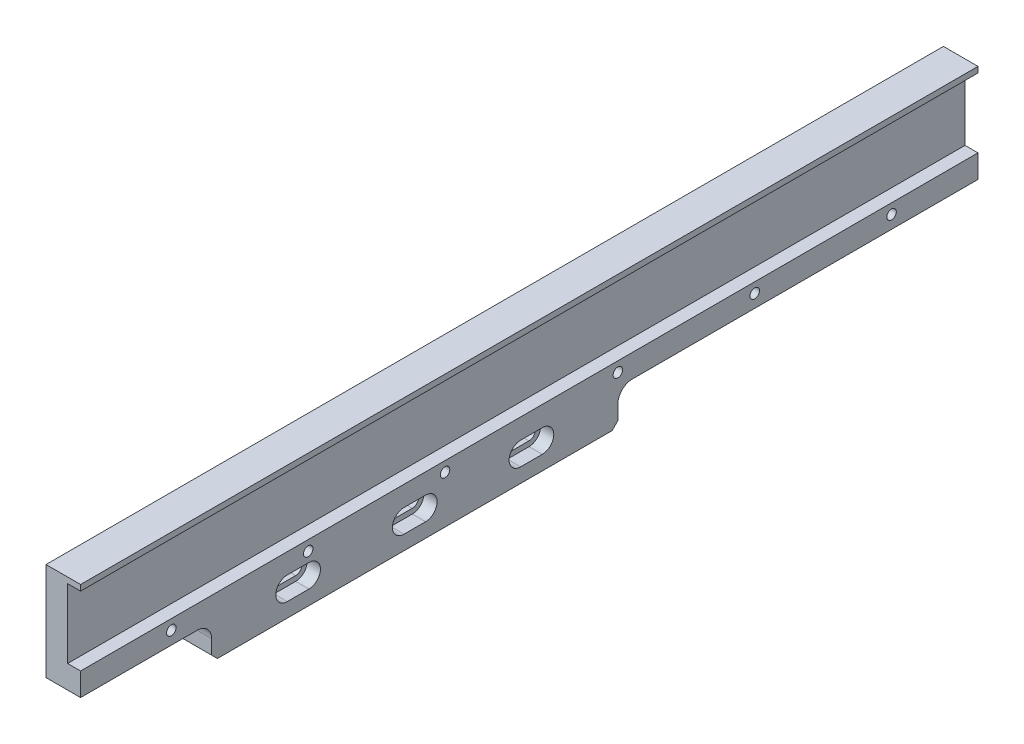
ISO-10303-21;
HEADER;
FILE_DESCRIPTION(('STEP AP214'),'2;1');
FILE_NAME('part.step','',(''),(''),'','','');
FILE_SCHEMA(('AUTOMOTIVE_DESIGN { 1 0 10303 214 1 1 1 1 }'));
ENDSEC;
DATA;
#1=APPLICATION_CONTEXT('core data for automotive mechanical design processes');
#2=APPLICATION_PROTOCOL_DEFINITION('international standard','automotive_design',2000,#1);
#3=PRODUCT_CONTEXT('',#1,'mechanical');
#4=PRODUCT('Part','Part','',(#3));
#5=PRODUCT_RELATED_PRODUCT_CATEGORY('part','',(#4));
#6=PRODUCT_DEFINITION_FORMATION('','',#4);
#7=PRODUCT_DEFINITION_CONTEXT('part definition',#1,'design');
#8=PRODUCT_DEFINITION('design','',#6,#7);
#9=PRODUCT_DEFINITION_SHAPE('','',#8);
#10=(LENGTH_UNIT() NAMED_UNIT(*) SI_UNIT(.MILLI.,.METRE.));
#11=(NAMED_UNIT(*) PLANE_ANGLE_UNIT() SI_UNIT($,.RADIAN.));
#12=(NAMED_UNIT(*) SI_UNIT($,.STERADIAN.) SOLID_ANGLE_UNIT());
#13=UNCERTAINTY_MEASURE_WITH_UNIT(LENGTH_MEASURE(1.E-05),#10,'distance_accuracy_value','');
#14=(GEOMETRIC_REPRESENTATION_CONTEXT(3) GLOBAL_UNCERTAINTY_ASSIGNED_CONTEXT((#13)) GLOBAL_UNIT_ASSIGNED_CONTEXT((#10,
#11,#12)) REPRESENTATION_CONTEXT('',''));
#15=CARTESIAN_POINT('',(0.,0.,0.));
#16=DIRECTION('',(0.,0.,1.));
#17=DIRECTION('',(1.,0.,0.));
#18=AXIS2_PLACEMENT_3D('',#15,#16,#17);
#19=CARTESIAN_POINT('',(112.,-18.6706080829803,322.));
#20=DIRECTION('',(-1.,0.,0.));
#21=DIRECTION('',(0.,0.,1.));
#22=AXIS2_PLACEMENT_3D('',#19,#20,#21);
#23=PLANE('',#22);
#24=CARTESIAN_POINT('',(112.,-14.1706080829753,16.0000000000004));
#25=DIRECTION('',(1.,0.,0.));
#26=DIRECTION('',(0.,0.,-1.));
#27=AXIS2_PLACEMENT_3D('',#24,#25,#26);
#28=CIRCLE('',#27,1.65);
#29=CARTESIAN_POINT('',(112.,-14.1706080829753,14.3500000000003));
#30=VERTEX_POINT('',#29);
#31=EDGE_CURVE('E683',#30,#30,#28,.T.);
#32=ORIENTED_EDGE('',*,*,#31,.F.);
#33=EDGE_LOOP('',(#32));
#34=FACE_BOUND('',#33,.T.);
#35=CARTESIAN_POINT('',(112.,-14.1706080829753,63.5));
#36=DIRECTION('',(1.,0.,0.));
#37=DIRECTION('',(0.,0.,-1.));
#38=AXIS2_PLACEMENT_3D('',#35,#36,#37);
#39=CIRCLE('',#38,1.65);
#40=CARTESIAN_POINT('',(112.,-14.1706080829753,61.85));
#41=VERTEX_POINT('',#40);
#42=EDGE_CURVE('E689',#41,#41,#39,.T.);
#43=ORIENTED_EDGE('',*,*,#42,.F.);
#44=EDGE_LOOP('',(#43));
#45=FACE_BOUND('',#44,.T.);
#46=CARTESIAN_POINT('',(112.,-14.1706080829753,111.));
#47=DIRECTION('',(1.,0.,0.));
#48=DIRECTION('',(0.,0.,-1.));
#49=AXIS2_PLACEMENT_3D('',#46,#47,#48);
#50=CIRCLE('',#49,1.65);
#51=CARTESIAN_POINT('',(112.,-14.1706080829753,109.35));
#52=VERTEX_POINT('',#51);
#53=EDGE_CURVE('E695',#52,#52,#50,.T.);
#54=ORIENTED_EDGE('',*,*,#53,.F.);
#55=EDGE_LOOP('',(#54));
#56=FACE_BOUND('',#55,.T.);
#57=CARTESIAN_POINT('',(112.,-14.1706080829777,171.));
#58=DIRECTION('',(1.,0.,0.));
#59=DIRECTION('',(0.,0.,-1.));
#60=AXIS2_PLACEMENT_3D('',#57,#58,#59);
#61=CIRCLE('',#60,1.65);
#62=CARTESIAN_POINT('',(112.,-14.1706080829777,169.35));
#63=VERTEX_POINT('',#62);
#64=EDGE_CURVE('E701',#63,#63,#61,.T.);
#65=ORIENTED_EDGE('',*,*,#64,.F.);
#66=EDGE_LOOP('',(#65));
#67=FACE_BOUND('',#66,.T.);
#68=CARTESIAN_POINT('',(112.,-14.1706080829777,218.5));
#69=DIRECTION('',(1.,0.,0.));
#70=DIRECTION('',(0.,0.,-1.));
#71=AXIS2_PLACEMENT_3D('',#68,#69,#70);
#72=CIRCLE('',#71,1.65);
#73=CARTESIAN_POINT('',(112.,-14.1706080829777,216.85));
#74=VERTEX_POINT('',#73);
#75=EDGE_CURVE('E707',#74,#74,#72,.T.);
#76=ORIENTED_EDGE('',*,*,#75,.F.);
#77=EDGE_LOOP('',(#76));
#78=FACE_BOUND('',#77,.T.);
#79=CARTESIAN_POINT('',(112.,-14.1706080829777,266.));
#80=DIRECTION('',(1.,0.,0.));
#81=DIRECTION('',(0.,0.,-1.));
#82=AXIS2_PLACEMENT_3D('',#79,#80,#81);
#83=CIRCLE('',#82,1.65);
#84=CARTESIAN_POINT('',(112.,-14.1706080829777,264.35));
#85=VERTEX_POINT('',#84);
#86=EDGE_CURVE('E713',#85,#85,#83,.T.);
#87=ORIENTED_EDGE('',*,*,#86,.F.);
#88=EDGE_LOOP('',(#87));
#89=FACE_BOUND('',#88,.T.);
#90=CARTESIAN_POINT('',(112.,-21.6706080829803,137.25));
#91=DIRECTION('',(1.,0.,0.));
#92=DIRECTION('',(0.,0.,-1.));
#93=AXIS2_PLACEMENT_3D('',#90,#91,#92);
#94=CIRCLE('',#93,4.);
#95=CARTESIAN_POINT('',(112.,-25.6706080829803,137.25));
#96=VERTEX_POINT('',#95);
#97=CARTESIAN_POINT('',(112.,-17.6706080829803,137.25));
#98=VERTEX_POINT('',#97);
#99=EDGE_CURVE('E445',#96,#98,#94,.T.);
#100=ORIENTED_EDGE('',*,*,#99,.F.);
#101=DIRECTION('',(0.,0.,1.));
#102=VECTOR('',#101,1.);
#103=CARTESIAN_POINT('',(112.,-25.6706080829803,137.25));
#104=LINE('',#103,#102);
#105=CARTESIAN_POINT('',(112.,-25.6706080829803,144.75));
#106=VERTEX_POINT('',#105);
#107=EDGE_CURVE('E435',#96,#106,#104,.T.);
#108=ORIENTED_EDGE('',*,*,#107,.T.);
#109=CARTESIAN_POINT('',(112.,-21.6706080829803,144.75));
#110=DIRECTION('',(1.,0.,0.));
#111=DIRECTION('',(0.,0.,-1.));
#112=AXIS2_PLACEMENT_3D('',#109,#110,#111);
#113=CIRCLE('',#112,4.);
#114=CARTESIAN_POINT('',(112.,-17.6706080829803,144.75));
#115=VERTEX_POINT('',#114);
#116=EDGE_CURVE('E465',#115,#106,#113,.T.);
#117=ORIENTED_EDGE('',*,*,#116,.F.);
#118=DIRECTION('',(0.,0.,1.));
#119=VECTOR('',#118,1.);
#120=CARTESIAN_POINT('',(112.,-17.6706080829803,137.25));
#121=LINE('',#120,#119);
#122=EDGE_CURVE('E417',#98,#115,#121,.T.);
#123=ORIENTED_EDGE('',*,*,#122,.F.);
#124=EDGE_LOOP('',(#100,#108,#117,#123));
#125=FACE_BOUND('',#124,.T.);
#126=CARTESIAN_POINT('',(112.,-21.6706080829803,177.75));
#127=DIRECTION('',(1.,0.,0.));
#128=DIRECTION('',(0.,0.,-1.));
#129=AXIS2_PLACEMENT_3D('',#126,#127,#128);
#130=CIRCLE('',#129,4.);
#131=CARTESIAN_POINT('',(112.,-25.6706080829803,177.75));
#132=VERTEX_POINT('',#131);
#133=CARTESIAN_POINT('',(112.,-17.6706080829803,177.75));
#134=VERTEX_POINT('',#133);
#135=EDGE_CURVE('E505',#132,#134,#130,.T.);
#136=ORIENTED_EDGE('',*,*,#135,.F.);
#137=DIRECTION('',(0.,0.,1.));
#138=VECTOR('',#137,1.);
#139=CARTESIAN_POINT('',(112.,-25.6706080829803,177.75));
#140=LINE('',#139,#138);
#141=CARTESIAN_POINT('',(112.,-25.6706080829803,185.25));
#142=VERTEX_POINT('',#141);
#143=EDGE_CURVE('E494',#132,#142,#140,.T.);
#144=ORIENTED_EDGE('',*,*,#143,.T.);
#145=CARTESIAN_POINT('',(112.,-21.6706080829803,185.25));
#146=DIRECTION('',(1.,0.,0.));
#147=DIRECTION('',(0.,0.,-1.));
#148=AXIS2_PLACEMENT_3D('',#145,#146,#147);
#149=CIRCLE('',#148,4.);
#150=CARTESIAN_POINT('',(112.,-17.6706080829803,185.25));
#151=VERTEX_POINT('',#150);
#152=EDGE_CURVE('E525',#151,#142,#149,.T.);
#153=ORIENTED_EDGE('',*,*,#152,.F.);
#154=DIRECTION('',(0.,0.,1.));
#155=VECTOR('',#154,1.);
#156=CARTESIAN_POINT('',(112.,-17.6706080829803,177.75));
#157=LINE('',#156,#155);
#158=EDGE_CURVE('E479',#134,#151,#157,.T.);
#159=ORIENTED_EDGE('',*,*,#158,.F.);
#160=EDGE_LOOP('',(#136,#144,#153,#159));
#161=FACE_BOUND('',#160,.T.);
#162=DIRECTION('',(0.,0.,-1.));
#163=VECTOR('',#162,1.);
#164=CARTESIAN_POINT('',(112.,-10.6706080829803,322.));
#165=LINE('',#164,#163);
#166=CARTESIAN_POINT('',(112.,-10.6706080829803,297.5));
#167=VERTEX_POINT('',#166);
#168=CARTESIAN_POINT('',(112.,-10.6706080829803,-14.));
#169=VERTEX_POINT('',#168);
#170=EDGE_CURVE('E317',#167,#169,#165,.T.);
#171=ORIENTED_EDGE('',*,*,#170,.F.);
#172=DIRECTION('',(0.,1.,0.));
#173=VECTOR('',#172,1.);
#174=CARTESIAN_POINT('',(112.,-18.6706080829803,297.5));
#175=LINE('',#174,#173);
#176=CARTESIAN_POINT('',(112.,-18.6706080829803,297.5));
#177=VERTEX_POINT('',#176);
#178=EDGE_CURVE('E284',#177,#167,#175,.T.);
#179=ORIENTED_EDGE('',*,*,#178,.F.);
#180=DIRECTION('',(0.,0.,-1.));
#181=VECTOR('',#180,1.);
#182=CARTESIAN_POINT('',(112.,-18.6706080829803,322.));
#183=LINE('',#182,#181);
#184=CARTESIAN_POINT('',(112.,-18.6706080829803,257.));
#185=VERTEX_POINT('',#184);
#186=EDGE_CURVE('E20',#177,#185,#183,.T.);
#187=ORIENTED_EDGE('',*,*,#186,.T.);
#188=CARTESIAN_POINT('',(112.,-23.6706080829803,257.));
#189=DIRECTION('',(-1.,0.,0.));
#190=DIRECTION('',(0.,0.,1.));
#191=AXIS2_PLACEMENT_3D('',#188,#189,#190);
#192=CIRCLE('',#191,5.);
#193=CARTESIAN_POINT('',(112.,-23.6706080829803,252.));
#194=VERTEX_POINT('',#193);
#195=EDGE_CURVE('E670',#185,#194,#192,.T.);
#196=ORIENTED_EDGE('',*,*,#195,.T.);
#197=DIRECTION('',(0.,-1.,0.));
#198=VECTOR('',#197,1.);
#199=CARTESIAN_POINT('',(112.,-18.6706080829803,252.));
#200=LINE('',#199,#198);
#201=CARTESIAN_POINT('',(112.,-28.6706080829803,252.));
#202=VERTEX_POINT('',#201);
#203=EDGE_CURVE('E322',#194,#202,#200,.T.);
#204=ORIENTED_EDGE('',*,*,#203,.T.);
#205=DIRECTION('',(0.,0.707106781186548,0.707106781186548));
#206=VECTOR('',#205,1.);
#207=CARTESIAN_POINT('',(112.,-28.6706080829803,252.));
#208=LINE('',#207,#206);
#209=CARTESIAN_POINT('',(112.,-30.6706080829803,250.));
#210=VERTEX_POINT('',#209);
#211=EDGE_CURVE('E365',#202,#210,#208,.F.);
#212=ORIENTED_EDGE('',*,*,#211,.T.);
#213=DIRECTION('',(0.,0.,-1.));
#214=VECTOR('',#213,1.);
#215=CARTESIAN_POINT('',(112.,-30.6706080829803,111.));
#216=LINE('',#215,#214);
#217=CARTESIAN_POINT('',(112.,-30.6706080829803,113.));
#218=VERTEX_POINT('',#217);
#219=EDGE_CURVE('E325',#210,#218,#216,.T.);
#220=ORIENTED_EDGE('',*,*,#219,.T.);
#221=DIRECTION('',(0.,-0.707106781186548,0.707106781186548));
#222=VECTOR('',#221,1.);
#223=CARTESIAN_POINT('',(112.,-30.6706080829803,113.));
#224=LINE('',#223,#222);
#225=CARTESIAN_POINT('',(112.,-28.6706080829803,111.));
#226=VERTEX_POINT('',#225);
#227=EDGE_CURVE('E340',#218,#226,#224,.F.);
#228=ORIENTED_EDGE('',*,*,#227,.T.);
#229=DIRECTION('',(0.,1.,0.));
#230=VECTOR('',#229,1.);
#231=CARTESIAN_POINT('',(112.,-18.6706080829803,111.));
#232=LINE('',#231,#230);
#233=CARTESIAN_POINT('',(112.,-23.6706080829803,111.));
#234=VERTEX_POINT('',#233);
#235=EDGE_CURVE('E326',#226,#234,#232,.T.);
#236=ORIENTED_EDGE('',*,*,#235,.T.);
#237=CARTESIAN_POINT('',(112.,-23.6706080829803,106.));
#238=DIRECTION('',(-1.,0.,0.));
#239=DIRECTION('',(0.,0.,1.));
#240=AXIS2_PLACEMENT_3D('',#237,#238,#239);
#241=CIRCLE('',#240,5.);
#242=CARTESIAN_POINT('',(112.,-18.6706080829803,106.));
#243=VERTEX_POINT('',#242);
#244=EDGE_CURVE('E668',#234,#243,#241,.T.);
#245=ORIENTED_EDGE('',*,*,#244,.T.);
#246=CARTESIAN_POINT('',(112.,-18.6706080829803,-14.));
#247=VERTEX_POINT('',#246);
#248=EDGE_CURVE('E315',#243,#247,#183,.T.);
#249=ORIENTED_EDGE('',*,*,#248,.T.);
#250=DIRECTION('',(0.,-1.,0.));
#251=VECTOR('',#250,1.);
#252=CARTESIAN_POINT('',(112.,-10.6706080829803,-14.));
#253=LINE('',#252,#251);
#254=EDGE_CURVE('E409',#169,#247,#253,.T.);
#255=ORIENTED_EDGE('',*,*,#254,.F.);
#256=EDGE_LOOP('',(#171,#179,#187,#196,#204,#212,#220,#228,#236,#245,#249,#255));
#257=FACE_BOUND('',#256,.T.);
#258=CARTESIAN_POINT('',(112.,-21.6706080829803,225.75));
#259=DIRECTION('',(1.,0.,0.));
#260=DIRECTION('',(0.,0.,-1.));
#261=AXIS2_PLACEMENT_3D('',#258,#259,#260);
#262=CIRCLE('',#261,4.);
#263=CARTESIAN_POINT('',(112.,-17.6706080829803,225.75));
#264=VERTEX_POINT('',#263);
#265=CARTESIAN_POINT('',(112.,-25.6706080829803,225.75));
#266=VERTEX_POINT('',#265);
#267=EDGE_CURVE('E586',#264,#266,#262,.T.);
#268=ORIENTED_EDGE('',*,*,#267,.F.);
#269=DIRECTION('',(0.,0.,1.));
#270=VECTOR('',#269,1.);
#271=CARTESIAN_POINT('',(112.,-17.6706080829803,218.25));
#272=LINE('',#271,#270);
#273=CARTESIAN_POINT('',(112.,-17.6706080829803,218.25));
#274=VERTEX_POINT('',#273);
#275=EDGE_CURVE('E539',#274,#264,#272,.T.);
#276=ORIENTED_EDGE('',*,*,#275,.F.);
#277=CARTESIAN_POINT('',(112.,-21.6706080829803,218.25));
#278=DIRECTION('',(1.,0.,0.));
#279=DIRECTION('',(0.,0.,-1.));
#280=AXIS2_PLACEMENT_3D('',#277,#278,#279);
#281=CIRCLE('',#280,4.);
#282=CARTESIAN_POINT('',(112.,-25.6706080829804,218.25));
#283=VERTEX_POINT('',#282);
#284=EDGE_CURVE('E566',#283,#274,#281,.T.);
#285=ORIENTED_EDGE('',*,*,#284,.F.);
#286=DIRECTION('',(0.,0.,1.));
#287=VECTOR('',#286,1.);
#288=CARTESIAN_POINT('',(112.,-25.6706080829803,218.25));
#289=LINE('',#288,#287);
#290=EDGE_CURVE('E554',#283,#266,#289,.T.);
#291=ORIENTED_EDGE('',*,*,#290,.T.);
#292=EDGE_LOOP('',(#268,#276,#285,#291));
#293=FACE_BOUND('',#292,.T.);
#294=ADVANCED_FACE('F16',(#34,#45,#56,#67,#78,#89,#125,#161,#257,#293),#23,.F.);
#295=CARTESIAN_POINT('',(100.,-18.6706080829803,322.));
#296=DIRECTION('',(0.,1.,0.));
#297=DIRECTION('',(0.,0.,1.));
#298=AXIS2_PLACEMENT_3D('',#295,#296,#297);
#299=PLANE('',#298);
#300=ORIENTED_EDGE('',*,*,#248,.F.);
#301=DIRECTION('',(1.,0.,0.));
#302=VECTOR('',#301,1.);
#303=CARTESIAN_POINT('',(100.,-18.6706080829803,106.));
#304=LINE('',#303,#302);
#305=CARTESIAN_POINT('',(100.,-18.6706080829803,106.));
#306=VERTEX_POINT('',#305);
#307=EDGE_CURVE('E301',#243,#306,#304,.F.);
#308=ORIENTED_EDGE('',*,*,#307,.T.);
#309=DIRECTION('',(0.,0.,-1.));
#310=VECTOR('',#309,1.);
#311=CARTESIAN_POINT('',(100.,-18.6706080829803,322.));
#312=LINE('',#311,#310);
#313=CARTESIAN_POINT('',(100.,-18.6706080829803,-14.));
#314=VERTEX_POINT('',#313);
#315=EDGE_CURVE('E299',#306,#314,#312,.T.);
#316=ORIENTED_EDGE('',*,*,#315,.T.);
#317=DIRECTION('',(-1.,0.,0.));
#318=VECTOR('',#317,1.);
#319=CARTESIAN_POINT('',(112.,-18.6706080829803,-14.));
#320=LINE('',#319,#318);
#321=EDGE_CURVE('E719',#247,#314,#320,.T.);
#322=ORIENTED_EDGE('',*,*,#321,.F.);
#323=EDGE_LOOP('',(#300,#308,#316,#322));
#324=FACE_BOUND('',#323,.T.);
#325=ADVANCED_FACE('F626',(#324),#299,.F.);
#326=CARTESIAN_POINT('',(100.,-18.6706080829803,322.));
#327=DIRECTION('',(1.,0.,0.));
#328=DIRECTION('',(0.,0.,-1.));
#329=AXIS2_PLACEMENT_3D('',#326,#327,#328);
#330=PLANE('',#329);
#331=CARTESIAN_POINT('',(100.,-14.1706080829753,16.0000000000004));
#332=DIRECTION('',(1.,0.,0.));
#333=DIRECTION('',(0.,0.,-1.));
#334=AXIS2_PLACEMENT_3D('',#331,#332,#333);
#335=CIRCLE('',#334,1.65);
#336=CARTESIAN_POINT('',(100.,-14.1706080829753,14.3500000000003));
#337=VERTEX_POINT('',#336);
#338=EDGE_CURVE('E686',#337,#337,#335,.T.);
#339=ORIENTED_EDGE('',*,*,#338,.T.);
#340=EDGE_LOOP('',(#339));
#341=FACE_BOUND('',#340,.T.);
#342=CARTESIAN_POINT('',(100.,-14.1706080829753,63.5));
#343=DIRECTION('',(1.,0.,0.));
#344=DIRECTION('',(0.,0.,-1.));
#345=AXIS2_PLACEMENT_3D('',#342,#343,#344);
#346=CIRCLE('',#345,1.65);
#347=CARTESIAN_POINT('',(100.,-14.1706080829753,61.85));
#348=VERTEX_POINT('',#347);
#349=EDGE_CURVE('E692',#348,#348,#346,.T.);
#350=ORIENTED_EDGE('',*,*,#349,.T.);
#351=EDGE_LOOP('',(#350));
#352=FACE_BOUND('',#351,.T.);
#353=CARTESIAN_POINT('',(100.,-14.1706080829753,111.));
#354=DIRECTION('',(1.,0.,0.));
#355=DIRECTION('',(0.,0.,-1.));
#356=AXIS2_PLACEMENT_3D('',#353,#354,#355);
#357=CIRCLE('',#356,1.65);
#358=CARTESIAN_POINT('',(100.,-14.1706080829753,109.35));
#359=VERTEX_POINT('',#358);
#360=EDGE_CURVE('E698',#359,#359,#357,.T.);
#361=ORIENTED_EDGE('',*,*,#360,.T.);
#362=EDGE_LOOP('',(#361));
#363=FACE_BOUND('',#362,.T.);
#364=CARTESIAN_POINT('',(100.,-14.1706080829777,171.));
#365=DIRECTION('',(1.,0.,0.));
#366=DIRECTION('',(0.,0.,-1.));
#367=AXIS2_PLACEMENT_3D('',#364,#365,#366);
#368=CIRCLE('',#367,1.65);
#369=CARTESIAN_POINT('',(100.,-14.1706080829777,169.35));
#370=VERTEX_POINT('',#369);
#371=EDGE_CURVE('E704',#370,#370,#368,.T.);
#372=ORIENTED_EDGE('',*,*,#371,.T.);
#373=EDGE_LOOP('',(#372));
#374=FACE_BOUND('',#373,.T.);
#375=CARTESIAN_POINT('',(100.,-14.1706080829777,218.5));
#376=DIRECTION('',(1.,0.,0.));
#377=DIRECTION('',(0.,0.,-1.));
#378=AXIS2_PLACEMENT_3D('',#375,#376,#377);
#379=CIRCLE('',#378,1.65);
#380=CARTESIAN_POINT('',(100.,-14.1706080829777,216.85));
#381=VERTEX_POINT('',#380);
#382=EDGE_CURVE('E710',#381,#381,#379,.T.);
#383=ORIENTED_EDGE('',*,*,#382,.T.);
#384=EDGE_LOOP('',(#383));
#385=FACE_BOUND('',#384,.T.);
#386=CARTESIAN_POINT('',(100.,-14.1706080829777,266.));
#387=DIRECTION('',(1.,0.,0.));
#388=DIRECTION('',(0.,0.,-1.));
#389=AXIS2_PLACEMENT_3D('',#386,#387,#388);
#390=CIRCLE('',#389,1.65);
#391=CARTESIAN_POINT('',(100.,-14.1706080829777,264.35));
#392=VERTEX_POINT('',#391);
#393=EDGE_CURVE('E716',#392,#392,#390,.T.);
#394=ORIENTED_EDGE('',*,*,#393,.T.);
#395=EDGE_LOOP('',(#394));
#396=FACE_BOUND('',#395,.T.);
#397=DIRECTION('',(0.,0.,1.));
#398=VECTOR('',#397,1.);
#399=CARTESIAN_POINT('',(100.,-19.4206080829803,137.25));
#400=LINE('',#399,#398);
#401=CARTESIAN_POINT('',(100.,-19.4206080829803,137.25));
#402=VERTEX_POINT('',#401);
#403=CARTESIAN_POINT('',(100.,-19.4206080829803,144.75));
#404=VERTEX_POINT('',#403);
#405=EDGE_CURVE('E426',#402,#404,#400,.T.);
#406=ORIENTED_EDGE('',*,*,#405,.T.);
#407=CARTESIAN_POINT('',(100.,-21.6706080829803,144.75));
#408=DIRECTION('',(1.,0.,0.));
#409=DIRECTION('',(0.,0.,-1.));
#410=AXIS2_PLACEMENT_3D('',#407,#408,#409);
#411=CIRCLE('',#410,2.25);
#412=CARTESIAN_POINT('',(100.,-23.9206080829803,144.75));
#413=VERTEX_POINT('',#412);
#414=EDGE_CURVE('E474',#404,#413,#411,.T.);
#415=ORIENTED_EDGE('',*,*,#414,.T.);
#416=DIRECTION('',(0.,0.,1.));
#417=VECTOR('',#416,1.);
#418=CARTESIAN_POINT('',(100.,-23.9206080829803,137.25));
#419=LINE('',#418,#417);
#420=CARTESIAN_POINT('',(100.,-23.9206080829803,137.25));
#421=VERTEX_POINT('',#420);
#422=EDGE_CURVE('E429',#421,#413,#419,.T.);
#423=ORIENTED_EDGE('',*,*,#422,.F.);
#424=CARTESIAN_POINT('',(100.,-21.6706080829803,137.25));
#425=DIRECTION('',(1.,0.,0.));
#426=DIRECTION('',(0.,0.,-1.));
#427=AXIS2_PLACEMENT_3D('',#424,#425,#426);
#428=CIRCLE('',#427,2.25);
#429=EDGE_CURVE('E451',#421,#402,#428,.T.);
#430=ORIENTED_EDGE('',*,*,#429,.T.);
#431=EDGE_LOOP('',(#406,#415,#423,#430));
#432=FACE_BOUND('',#431,.T.);
#433=CARTESIAN_POINT('',(100.,-21.6706080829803,185.25));
#434=DIRECTION('',(1.,0.,0.));
#435=DIRECTION('',(0.,0.,-1.));
#436=AXIS2_PLACEMENT_3D('',#433,#434,#435);
#437=CIRCLE('',#436,2.25);
#438=CARTESIAN_POINT('',(100.,-19.4206080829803,185.25));
#439=VERTEX_POINT('',#438);
#440=CARTESIAN_POINT('',(100.,-23.9206080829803,185.25));
#441=VERTEX_POINT('',#440);
#442=EDGE_CURVE('E534',#439,#441,#437,.T.);
#443=ORIENTED_EDGE('',*,*,#442,.T.);
#444=DIRECTION('',(0.,0.,1.));
#445=VECTOR('',#444,1.);
#446=CARTESIAN_POINT('',(100.,-23.9206080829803,177.75));
#447=LINE('',#446,#445);
#448=CARTESIAN_POINT('',(100.,-23.9206080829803,177.75));
#449=VERTEX_POINT('',#448);
#450=EDGE_CURVE('E488',#449,#441,#447,.T.);
#451=ORIENTED_EDGE('',*,*,#450,.F.);
#452=CARTESIAN_POINT('',(100.,-21.6706080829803,177.75));
#453=DIRECTION('',(1.,0.,0.));
#454=DIRECTION('',(0.,0.,-1.));
#455=AXIS2_PLACEMENT_3D('',#452,#453,#454);
#456=CIRCLE('',#455,2.25);
#457=CARTESIAN_POINT('',(100.,-19.4206080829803,177.75));
#458=VERTEX_POINT('',#457);
#459=EDGE_CURVE('E512',#449,#458,#456,.T.);
#460=ORIENTED_EDGE('',*,*,#459,.T.);
#461=DIRECTION('',(0.,0.,1.));
#462=VECTOR('',#461,1.);
#463=CARTESIAN_POINT('',(100.,-19.4206080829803,177.75));
#464=LINE('',#463,#462);
#465=EDGE_CURVE('E485',#458,#439,#464,.T.);
#466=ORIENTED_EDGE('',*,*,#465,.T.);
#467=EDGE_LOOP('',(#443,#451,#460,#466));
#468=FACE_BOUND('',#467,.T.);
#469=CARTESIAN_POINT('',(100.,-21.6706080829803,218.25));
#470=DIRECTION('',(1.,0.,0.));
#471=DIRECTION('',(0.,0.,-1.));
#472=AXIS2_PLACEMENT_3D('',#469,#470,#471);
#473=CIRCLE('',#472,2.25);
#474=CARTESIAN_POINT('',(100.,-23.9206080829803,218.25));
#475=VERTEX_POINT('',#474);
#476=CARTESIAN_POINT('',(100.,-19.4206080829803,218.25));
#477=VERTEX_POINT('',#476);
#478=EDGE_CURVE('E572',#475,#477,#473,.T.);
#479=ORIENTED_EDGE('',*,*,#478,.T.);
#480=DIRECTION('',(0.,0.,1.));
#481=VECTOR('',#480,1.);
#482=CARTESIAN_POINT('',(100.,-19.4206080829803,218.25));
#483=LINE('',#482,#481);
#484=CARTESIAN_POINT('',(100.,-19.4206080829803,225.75));
#485=VERTEX_POINT('',#484);
#486=EDGE_CURVE('E545',#477,#485,#483,.T.);
#487=ORIENTED_EDGE('',*,*,#486,.T.);
#488=CARTESIAN_POINT('',(100.,-21.6706080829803,225.75));
#489=DIRECTION('',(1.,0.,0.));
#490=DIRECTION('',(0.,0.,-1.));
#491=AXIS2_PLACEMENT_3D('',#488,#489,#490);
#492=CIRCLE('',#491,2.25);
#493=CARTESIAN_POINT('',(100.,-23.9206080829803,225.75));
#494=VERTEX_POINT('',#493);
#495=EDGE_CURVE('E374',#485,#494,#492,.T.);
#496=ORIENTED_EDGE('',*,*,#495,.T.);
#497=DIRECTION('',(0.,0.,1.));
#498=VECTOR('',#497,1.);
#499=CARTESIAN_POINT('',(100.,-23.9206080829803,218.25));
#500=LINE('',#499,#498);
#501=EDGE_CURVE('E548',#475,#494,#500,.T.);
#502=ORIENTED_EDGE('',*,*,#501,.F.);
#503=EDGE_LOOP('',(#479,#487,#496,#502));
#504=FACE_BOUND('',#503,.T.);
#505=CARTESIAN_POINT('',(100.,-18.6706080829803,297.5));
#506=VERTEX_POINT('',#505);
#507=CARTESIAN_POINT('',(100.,-18.6706080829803,257.));
#508=VERTEX_POINT('',#507);
#509=EDGE_CURVE('E290',#506,#508,#312,.T.);
#510=ORIENTED_EDGE('',*,*,#509,.F.);
#511=DIRECTION('',(0.,1.,0.));
#512=VECTOR('',#511,1.);
#513=CARTESIAN_POINT('',(100.,-18.6706080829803,297.5));
#514=LINE('',#513,#512);
#515=CARTESIAN_POINT('',(100.,15.3293919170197,297.5));
#516=VERTEX_POINT('',#515);
#517=EDGE_CURVE('E275',#506,#516,#514,.T.);
#518=ORIENTED_EDGE('',*,*,#517,.T.);
#519=DIRECTION('',(0.,0.,-1.));
#520=VECTOR('',#519,1.);
#521=CARTESIAN_POINT('',(100.,15.3293919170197,322.));
#522=LINE('',#521,#520);
#523=CARTESIAN_POINT('',(100.,15.3293919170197,-14.));
#524=VERTEX_POINT('',#523);
#525=EDGE_CURVE('E362',#516,#524,#522,.T.);
#526=ORIENTED_EDGE('',*,*,#525,.T.);
#527=DIRECTION('',(0.,1.,0.));
#528=VECTOR('',#527,1.);
#529=CARTESIAN_POINT('',(100.,-18.6706080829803,-14.));
#530=LINE('',#529,#528);
#531=EDGE_CURVE('E721',#314,#524,#530,.T.);
#532=ORIENTED_EDGE('',*,*,#531,.F.);
#533=ORIENTED_EDGE('',*,*,#315,.F.);
#534=CARTESIAN_POINT('',(100.,-23.6706080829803,106.));
#535=DIRECTION('',(1.,0.,0.));
#536=DIRECTION('',(0.,0.,-1.));
#537=AXIS2_PLACEMENT_3D('',#534,#535,#536);
#538=CIRCLE('',#537,5.);
#539=CARTESIAN_POINT('',(100.,-23.6706080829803,111.));
#540=VERTEX_POINT('',#539);
#541=EDGE_CURVE('E669',#306,#540,#538,.T.);
#542=ORIENTED_EDGE('',*,*,#541,.T.);
#543=DIRECTION('',(0.,1.,0.));
#544=VECTOR('',#543,1.);
#545=CARTESIAN_POINT('',(100.,-18.6706080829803,111.));
#546=LINE('',#545,#544);
#547=CARTESIAN_POINT('',(100.,-28.6706080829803,111.));
#548=VERTEX_POINT('',#547);
#549=EDGE_CURVE('E331',#548,#540,#546,.T.);
#550=ORIENTED_EDGE('',*,*,#549,.F.);
#551=DIRECTION('',(0.,0.707106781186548,-0.707106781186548));
#552=VECTOR('',#551,1.);
#553=CARTESIAN_POINT('',(100.,-30.6706080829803,113.));
#554=LINE('',#553,#552);
#555=CARTESIAN_POINT('',(100.,-30.6706080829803,113.));
#556=VERTEX_POINT('',#555);
#557=EDGE_CURVE('E26',#548,#556,#554,.F.);
#558=ORIENTED_EDGE('',*,*,#557,.T.);
#559=DIRECTION('',(0.,0.,-1.));
#560=VECTOR('',#559,1.);
#561=CARTESIAN_POINT('',(100.,-30.6706080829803,111.));
#562=LINE('',#561,#560);
#563=CARTESIAN_POINT('',(100.,-30.6706080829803,250.));
#564=VERTEX_POINT('',#563);
#565=EDGE_CURVE('E330',#564,#556,#562,.T.);
#566=ORIENTED_EDGE('',*,*,#565,.F.);
#567=DIRECTION('',(0.,-0.707106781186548,-0.707106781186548));
#568=VECTOR('',#567,1.);
#569=CARTESIAN_POINT('',(100.,-28.6706080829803,252.));
#570=LINE('',#569,#568);
#571=CARTESIAN_POINT('',(100.,-28.6706080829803,252.));
#572=VERTEX_POINT('',#571);
#573=EDGE_CURVE('E344',#564,#572,#570,.F.);
#574=ORIENTED_EDGE('',*,*,#573,.T.);
#575=DIRECTION('',(0.,-1.,0.));
#576=VECTOR('',#575,1.);
#577=CARTESIAN_POINT('',(100.,-18.6706080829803,252.));
#578=LINE('',#577,#576);
#579=CARTESIAN_POINT('',(100.,-23.6706080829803,252.));
#580=VERTEX_POINT('',#579);
#581=EDGE_CURVE('E327',#580,#572,#578,.T.);
#582=ORIENTED_EDGE('',*,*,#581,.F.);
#583=CARTESIAN_POINT('',(100.,-23.6706080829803,257.));
#584=DIRECTION('',(1.,0.,0.));
#585=DIRECTION('',(0.,0.,-1.));
#586=AXIS2_PLACEMENT_3D('',#583,#584,#585);
#587=CIRCLE('',#586,5.);
#588=EDGE_CURVE('E296',#580,#508,#587,.T.);
#589=ORIENTED_EDGE('',*,*,#588,.T.);
#590=EDGE_LOOP('',(#510,#518,#526,#532,#533,#542,#550,#558,#566,#574,#582,#589));
#591=FACE_BOUND('',#590,.T.);
#592=ADVANCED_FACE('F293',(#341,#352,#363,#374,#385,#396,#432,#468,#504,#591),#330,.F.);
#593=ORIENTED_EDGE('',*,*,#186,.F.);
#594=DIRECTION('',(1.,0.,0.));
#595=VECTOR('',#594,1.);
#596=CARTESIAN_POINT('',(100.,-18.6706080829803,297.5));
#597=LINE('',#596,#595);
#598=EDGE_CURVE('E278',#506,#177,#597,.T.);
#599=ORIENTED_EDGE('',*,*,#598,.F.);
#600=ORIENTED_EDGE('',*,*,#509,.T.);
#601=DIRECTION('',(1.,0.,0.));
#602=VECTOR('',#601,1.);
#603=CARTESIAN_POINT('',(100.,-18.6706080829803,257.));
#604=LINE('',#603,#602);
#605=EDGE_CURVE('E319',#508,#185,#604,.T.);
#606=ORIENTED_EDGE('',*,*,#605,.T.);
#607=EDGE_LOOP('',(#593,#599,#600,#606));
#608=FACE_BOUND('',#607,.T.);
#609=ADVANCED_FACE('F288',(#608),#299,.F.);
#610=CARTESIAN_POINT('',(112.,-10.6706080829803,322.));
#611=DIRECTION('',(0.,-1.,0.));
#612=DIRECTION('',(1.,0.,0.));
#613=AXIS2_PLACEMENT_3D('',#610,#611,#612);
#614=PLANE('',#613);
#615=DIRECTION('',(0.,0.,-1.));
#616=VECTOR('',#615,1.);
#617=CARTESIAN_POINT('',(107.5,-10.6706080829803,322.));
#618=LINE('',#617,#616);
#619=CARTESIAN_POINT('',(107.5,-10.6706080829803,297.5));
#620=VERTEX_POINT('',#619);
#621=CARTESIAN_POINT('',(107.5,-10.6706080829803,-14.));
#622=VERTEX_POINT('',#621);
#623=EDGE_CURVE('E393',#620,#622,#618,.T.);
#624=ORIENTED_EDGE('',*,*,#623,.F.);
#625=DIRECTION('',(1.,0.,0.));
#626=VECTOR('',#625,1.);
#627=CARTESIAN_POINT('',(112.,-10.6706080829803,297.5));
#628=LINE('',#627,#626);
#629=EDGE_CURVE('E402',#620,#167,#628,.T.);
#630=ORIENTED_EDGE('',*,*,#629,.T.);
#631=ORIENTED_EDGE('',*,*,#170,.T.);
#632=DIRECTION('',(1.,0.,0.));
#633=VECTOR('',#632,1.);
#634=CARTESIAN_POINT('',(107.5,-10.6706080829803,-14.));
#635=LINE('',#634,#633);
#636=EDGE_CURVE('E401',#622,#169,#635,.T.);
#637=ORIENTED_EDGE('',*,*,#636,.F.);
#638=EDGE_LOOP('',(#624,#630,#631,#637));
#639=FACE_BOUND('',#638,.T.);
#640=ADVANCED_FACE('F400',(#639),#614,.F.);
#641=CARTESIAN_POINT('',(107.5,-10.6706080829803,322.));
#642=DIRECTION('',(-1.,0.,0.));
#643=DIRECTION('',(0.,0.,1.));
#644=AXIS2_PLACEMENT_3D('',#641,#642,#643);
#645=PLANE('',#644);
#646=DIRECTION('',(0.,0.,-1.));
#647=VECTOR('',#646,1.);
#648=CARTESIAN_POINT('',(107.5,13.3293919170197,322.));
#649=LINE('',#648,#647);
#650=CARTESIAN_POINT('',(107.5,13.3293919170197,297.5));
#651=VERTEX_POINT('',#650);
#652=CARTESIAN_POINT('',(107.5,13.3293919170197,-14.));
#653=VERTEX_POINT('',#652);
#654=EDGE_CURVE('E391',#651,#653,#649,.T.);
#655=ORIENTED_EDGE('',*,*,#654,.F.);
#656=DIRECTION('',(0.,-1.,0.));
#657=VECTOR('',#656,1.);
#658=CARTESIAN_POINT('',(107.5,-10.6706080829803,297.5));
#659=LINE('',#658,#657);
#660=EDGE_CURVE('E679',#651,#620,#659,.T.);
#661=ORIENTED_EDGE('',*,*,#660,.T.);
#662=ORIENTED_EDGE('',*,*,#623,.T.);
#663=DIRECTION('',(0.,-1.,0.));
#664=VECTOR('',#663,1.);
#665=CARTESIAN_POINT('',(107.5,13.3293919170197,-14.));
#666=LINE('',#665,#664);
#667=EDGE_CURVE('E413',#653,#622,#666,.T.);
#668=ORIENTED_EDGE('',*,*,#667,.F.);
#669=EDGE_LOOP('',(#655,#661,#662,#668));
#670=FACE_BOUND('',#669,.T.);
#671=ADVANCED_FACE('F737',(#670),#645,.F.);
#672=CARTESIAN_POINT('',(112.,13.3293919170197,322.));
#673=DIRECTION('',(0.,1.,0.));
#674=DIRECTION('',(0.,0.,1.));
#675=AXIS2_PLACEMENT_3D('',#672,#673,#674);
#676=PLANE('',#675);
#677=DIRECTION('',(0.,0.,-1.));
#678=VECTOR('',#677,1.);
#679=CARTESIAN_POINT('',(112.,13.3293919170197,322.));
#680=LINE('',#679,#678);
#681=CARTESIAN_POINT('',(112.,13.3293919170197,297.5));
#682=VERTEX_POINT('',#681);
#683=CARTESIAN_POINT('',(112.,13.3293919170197,-14.));
#684=VERTEX_POINT('',#683);
#685=EDGE_CURVE('E389',#682,#684,#680,.T.);
#686=ORIENTED_EDGE('',*,*,#685,.F.);
#687=DIRECTION('',(-1.,0.,0.));
#688=VECTOR('',#687,1.);
#689=CARTESIAN_POINT('',(112.,13.3293919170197,297.5));
#690=LINE('',#689,#688);
#691=EDGE_CURVE('E675',#682,#651,#690,.T.);
#692=ORIENTED_EDGE('',*,*,#691,.T.);
#693=ORIENTED_EDGE('',*,*,#654,.T.);
#694=DIRECTION('',(-1.,0.,0.));
#695=VECTOR('',#694,1.);
#696=CARTESIAN_POINT('',(112.,13.3293919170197,-14.));
#697=LINE('',#696,#695);
#698=EDGE_CURVE('E730',#684,#653,#697,.T.);
#699=ORIENTED_EDGE('',*,*,#698,.F.);
#700=EDGE_LOOP('',(#686,#692,#693,#699));
#701=FACE_BOUND('',#700,.T.);
#702=ADVANCED_FACE('F738',(#701),#676,.F.);
#703=CARTESIAN_POINT('',(112.,13.3293919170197,322.));
#704=DIRECTION('',(-1.,0.,0.));
#705=DIRECTION('',(0.,0.,1.));
#706=AXIS2_PLACEMENT_3D('',#703,#704,#705);
#707=PLANE('',#706);
#708=DIRECTION('',(0.,0.,-1.));
#709=VECTOR('',#708,1.);
#710=CARTESIAN_POINT('',(112.,15.3293919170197,322.));
#711=LINE('',#710,#709);
#712=CARTESIAN_POINT('',(112.,15.3293919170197,297.5));
#713=VERTEX_POINT('',#712);
#714=CARTESIAN_POINT('',(112.,15.3293919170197,-14.));
#715=VERTEX_POINT('',#714);
#716=EDGE_CURVE('E387',#713,#715,#711,.T.);
#717=ORIENTED_EDGE('',*,*,#716,.F.);
#718=EDGE_CURVE('E34',#682,#713,#175,.T.);
#719=ORIENTED_EDGE('',*,*,#718,.F.);
#720=ORIENTED_EDGE('',*,*,#685,.T.);
#721=DIRECTION('',(0.,-1.,0.));
#722=VECTOR('',#721,1.);
#723=CARTESIAN_POINT('',(112.,15.3293919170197,-14.));
#724=LINE('',#723,#722);
#725=EDGE_CURVE('E727',#715,#684,#724,.T.);
#726=ORIENTED_EDGE('',*,*,#725,.F.);
#727=EDGE_LOOP('',(#717,#719,#720,#726));
#728=FACE_BOUND('',#727,.T.);
#729=ADVANCED_FACE('F741',(#728),#707,.F.);
#730=CARTESIAN_POINT('',(100.,15.3293919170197,322.));
#731=DIRECTION('',(0.,-1.,0.));
#732=DIRECTION('',(0.,0.,-1.));
#733=AXIS2_PLACEMENT_3D('',#730,#731,#732);
#734=PLANE('',#733);
#735=ORIENTED_EDGE('',*,*,#525,.F.);
#736=DIRECTION('',(1.,0.,0.));
#737=VECTOR('',#736,1.);
#738=CARTESIAN_POINT('',(100.,15.3293919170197,297.5));
#739=LINE('',#738,#737);
#740=EDGE_CURVE('E280',#516,#713,#739,.T.);
#741=ORIENTED_EDGE('',*,*,#740,.T.);
#742=ORIENTED_EDGE('',*,*,#716,.T.);
#743=DIRECTION('',(1.,0.,0.));
#744=VECTOR('',#743,1.);
#745=CARTESIAN_POINT('',(100.,15.3293919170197,-14.));
#746=LINE('',#745,#744);
#747=EDGE_CURVE('E724',#524,#715,#746,.T.);
#748=ORIENTED_EDGE('',*,*,#747,.F.);
#749=EDGE_LOOP('',(#735,#741,#742,#748));
#750=FACE_BOUND('',#749,.T.);
#751=ADVANCED_FACE('F744',(#750),#734,.F.);
#752=CARTESIAN_POINT('',(100.,-18.6706080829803,111.));
#753=DIRECTION('',(0.,0.,-1.));
#754=DIRECTION('',(-1.,0.,0.));
#755=AXIS2_PLACEMENT_3D('',#752,#753,#754);
#756=PLANE('',#755);
#757=ORIENTED_EDGE('',*,*,#235,.F.);
#758=DIRECTION('',(-1.,0.,0.));
#759=VECTOR('',#758,1.);
#760=CARTESIAN_POINT('',(100.,-28.6706080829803,111.));
#761=LINE('',#760,#759);
#762=EDGE_CURVE('E342',#226,#548,#761,.T.);
#763=ORIENTED_EDGE('',*,*,#762,.T.);
#764=ORIENTED_EDGE('',*,*,#549,.T.);
#765=DIRECTION('',(1.,0.,0.));
#766=VECTOR('',#765,1.);
#767=CARTESIAN_POINT('',(100.,-23.6706080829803,111.));
#768=LINE('',#767,#766);
#769=EDGE_CURVE('E298',#540,#234,#768,.T.);
#770=ORIENTED_EDGE('',*,*,#769,.T.);
#771=EDGE_LOOP('',(#757,#763,#764,#770));
#772=FACE_BOUND('',#771,.T.);
#773=ADVANCED_FACE('F751',(#772),#756,.T.);
#774=CARTESIAN_POINT('',(100.,-30.6706080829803,111.));
#775=DIRECTION('',(0.,-1.,0.));
#776=DIRECTION('',(0.,0.,-1.));
#777=AXIS2_PLACEMENT_3D('',#774,#775,#776);
#778=PLANE('',#777);
#779=ORIENTED_EDGE('',*,*,#565,.T.);
#780=DIRECTION('',(1.,0.,0.));
#781=VECTOR('',#780,1.);
#782=CARTESIAN_POINT('',(100.,-30.6706080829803,113.));
#783=LINE('',#782,#781);
#784=EDGE_CURVE('E358',#556,#218,#783,.T.);
#785=ORIENTED_EDGE('',*,*,#784,.T.);
#786=ORIENTED_EDGE('',*,*,#219,.F.);
#787=DIRECTION('',(-1.,0.,0.));
#788=VECTOR('',#787,1.);
#789=CARTESIAN_POINT('',(100.,-30.6706080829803,250.));
#790=LINE('',#789,#788);
#791=EDGE_CURVE('E361',#210,#564,#790,.T.);
#792=ORIENTED_EDGE('',*,*,#791,.T.);
#793=EDGE_LOOP('',(#779,#785,#786,#792));
#794=FACE_BOUND('',#793,.T.);
#795=ADVANCED_FACE('F356',(#794),#778,.T.);
#796=CARTESIAN_POINT('',(100.,-18.6706080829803,252.));
#797=DIRECTION('',(0.,0.,1.));
#798=DIRECTION('',(1.,0.,0.));
#799=AXIS2_PLACEMENT_3D('',#796,#797,#798);
#800=PLANE('',#799);
#801=ORIENTED_EDGE('',*,*,#581,.T.);
#802=DIRECTION('',(1.,0.,0.));
#803=VECTOR('',#802,1.);
#804=CARTESIAN_POINT('',(100.,-28.6706080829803,252.));
#805=LINE('',#804,#803);
#806=EDGE_CURVE('E11',#572,#202,#805,.T.);
#807=ORIENTED_EDGE('',*,*,#806,.T.);
#808=ORIENTED_EDGE('',*,*,#203,.F.);
#809=DIRECTION('',(1.,0.,0.));
#810=VECTOR('',#809,1.);
#811=CARTESIAN_POINT('',(100.,-23.6706080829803,252.));
#812=LINE('',#811,#810);
#813=EDGE_CURVE('E321',#194,#580,#812,.F.);
#814=ORIENTED_EDGE('',*,*,#813,.T.);
#815=EDGE_LOOP('',(#801,#807,#808,#814));
#816=FACE_BOUND('',#815,.T.);
#817=ADVANCED_FACE('F648',(#816),#800,.T.);
#818=CARTESIAN_POINT('',(100.,-23.6706080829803,106.));
#819=DIRECTION('',(1.,0.,0.));
#820=DIRECTION('',(0.,0.,-1.));
#821=AXIS2_PLACEMENT_3D('',#818,#819,#820);
#822=CYLINDRICAL_SURFACE('',#821,5.);
#823=ORIENTED_EDGE('',*,*,#541,.F.);
#824=ORIENTED_EDGE('',*,*,#307,.F.);
#825=ORIENTED_EDGE('',*,*,#244,.F.);
#826=ORIENTED_EDGE('',*,*,#769,.F.);
#827=EDGE_LOOP('',(#823,#824,#825,#826));
#828=FACE_BOUND('',#827,.T.);
#829=ADVANCED_FACE('F644',(#828),#822,.F.);
#830=CARTESIAN_POINT('',(100.,-23.6706080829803,257.));
#831=DIRECTION('',(1.,0.,0.));
#832=DIRECTION('',(0.,0.,-1.));
#833=AXIS2_PLACEMENT_3D('',#830,#831,#832);
#834=CYLINDRICAL_SURFACE('',#833,5.);
#835=ORIENTED_EDGE('',*,*,#588,.F.);
#836=ORIENTED_EDGE('',*,*,#813,.F.);
#837=ORIENTED_EDGE('',*,*,#195,.F.);
#838=ORIENTED_EDGE('',*,*,#605,.F.);
#839=EDGE_LOOP('',(#835,#836,#837,#838));
#840=FACE_BOUND('',#839,.T.);
#841=ADVANCED_FACE('F647',(#840),#834,.F.);
#842=CARTESIAN_POINT('',(100.,-30.6706080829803,113.));
#843=DIRECTION('',(0.,0.707106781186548,0.707106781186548));
#844=DIRECTION('',(1.,0.,0.));
#845=AXIS2_PLACEMENT_3D('',#842,#843,#844);
#846=PLANE('',#845);
#847=ORIENTED_EDGE('',*,*,#557,.F.);
#848=ORIENTED_EDGE('',*,*,#762,.F.);
#849=ORIENTED_EDGE('',*,*,#227,.F.);
#850=ORIENTED_EDGE('',*,*,#784,.F.);
#851=EDGE_LOOP('',(#847,#848,#849,#850));
#852=FACE_BOUND('',#851,.T.);
#853=ADVANCED_FACE('F364',(#852),#846,.F.);
#854=CARTESIAN_POINT('',(100.,-28.6706080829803,252.));
#855=DIRECTION('',(0.,0.707106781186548,-0.707106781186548));
#856=DIRECTION('',(1.,0.,0.));
#857=AXIS2_PLACEMENT_3D('',#854,#855,#856);
#858=PLANE('',#857);
#859=ORIENTED_EDGE('',*,*,#573,.F.);
#860=ORIENTED_EDGE('',*,*,#791,.F.);
#861=ORIENTED_EDGE('',*,*,#211,.F.);
#862=ORIENTED_EDGE('',*,*,#806,.F.);
#863=EDGE_LOOP('',(#859,#860,#861,#862));
#864=FACE_BOUND('',#863,.T.);
#865=ADVANCED_FACE('F18',(#864),#858,.F.);
#866=CARTESIAN_POINT('',(112.,-21.6706080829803,225.75));
#867=DIRECTION('',(1.,0.,0.));
#868=DIRECTION('',(0.,0.,-1.));
#869=AXIS2_PLACEMENT_3D('',#866,#867,#868);
#870=CYLINDRICAL_SURFACE('',#869,2.25);
#871=ORIENTED_EDGE('',*,*,#495,.F.);
#872=DIRECTION('',(-1.,0.,0.));
#873=VECTOR('',#872,1.);
#874=CARTESIAN_POINT('',(100.,-19.4206080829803,225.75));
#875=LINE('',#874,#873);
#876=CARTESIAN_POINT('',(107.4,-19.4206080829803,225.75));
#877=VERTEX_POINT('',#876);
#878=EDGE_CURVE('E583',#877,#485,#875,.T.);
#879=ORIENTED_EDGE('',*,*,#878,.F.);
#880=CARTESIAN_POINT('',(107.4,-21.6706080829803,225.75));
#881=DIRECTION('',(1.,0.,0.));
#882=DIRECTION('',(0.,0.,-1.));
#883=AXIS2_PLACEMENT_3D('',#880,#881,#882);
#884=CIRCLE('',#883,2.25);
#885=CARTESIAN_POINT('',(107.4,-23.9206080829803,225.75));
#886=VERTEX_POINT('',#885);
#887=EDGE_CURVE('E381',#877,#886,#884,.T.);
#888=ORIENTED_EDGE('',*,*,#887,.T.);
#889=DIRECTION('',(1.,0.,0.));
#890=VECTOR('',#889,1.);
#891=CARTESIAN_POINT('',(112.,-23.9206080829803,225.75));
#892=LINE('',#891,#890);
#893=EDGE_CURVE('E577',#494,#886,#892,.T.);
#894=ORIENTED_EDGE('',*,*,#893,.F.);
#895=EDGE_LOOP('',(#871,#879,#888,#894));
#896=FACE_BOUND('',#895,.T.);
#897=ADVANCED_FACE('F595',(#896),#870,.F.);
#898=CARTESIAN_POINT('',(107.4,-19.4206080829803,225.75));
#899=DIRECTION('',(-1.,0.,0.));
#900=DIRECTION('',(0.,0.,1.));
#901=AXIS2_PLACEMENT_3D('',#898,#899,#900);
#902=PLANE('',#901);
#903=DIRECTION('',(0.,0.,1.));
#904=VECTOR('',#903,1.);
#905=CARTESIAN_POINT('',(107.4,-25.6706080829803,218.25));
#906=LINE('',#905,#904);
#907=CARTESIAN_POINT('',(107.4,-25.6706080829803,218.25));
#908=VERTEX_POINT('',#907);
#909=CARTESIAN_POINT('',(107.4,-25.6706080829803,225.75));
#910=VERTEX_POINT('',#909);
#911=EDGE_CURVE('E552',#908,#910,#906,.T.);
#912=ORIENTED_EDGE('',*,*,#911,.F.);
#913=CARTESIAN_POINT('',(107.4,-21.6706080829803,218.25));
#914=DIRECTION('',(1.,0.,0.));
#915=DIRECTION('',(0.,0.,-1.));
#916=AXIS2_PLACEMENT_3D('',#913,#914,#915);
#917=CIRCLE('',#916,4.);
#918=CARTESIAN_POINT('',(107.4,-17.6706080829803,218.25));
#919=VERTEX_POINT('',#918);
#920=EDGE_CURVE('E568',#908,#919,#917,.T.);
#921=ORIENTED_EDGE('',*,*,#920,.T.);
#922=DIRECTION('',(0.,0.,1.));
#923=VECTOR('',#922,1.);
#924=CARTESIAN_POINT('',(107.4,-17.6706080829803,218.25));
#925=LINE('',#924,#923);
#926=CARTESIAN_POINT('',(107.4,-17.6706080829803,225.75));
#927=VERTEX_POINT('',#926);
#928=EDGE_CURVE('E541',#919,#927,#925,.T.);
#929=ORIENTED_EDGE('',*,*,#928,.T.);
#930=CARTESIAN_POINT('',(107.4,-21.6706080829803,225.75));
#931=DIRECTION('',(1.,0.,0.));
#932=DIRECTION('',(0.,0.,-1.));
#933=AXIS2_PLACEMENT_3D('',#930,#931,#932);
#934=CIRCLE('',#933,4.);
#935=EDGE_CURVE('E588',#927,#910,#934,.T.);
#936=ORIENTED_EDGE('',*,*,#935,.T.);
#937=EDGE_LOOP('',(#912,#921,#929,#936));
#938=FACE_BOUND('',#937,.T.);
#939=ORIENTED_EDGE('',*,*,#887,.F.);
#940=DIRECTION('',(0.,0.,1.));
#941=VECTOR('',#940,1.);
#942=CARTESIAN_POINT('',(107.4,-19.4206080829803,218.25));
#943=LINE('',#942,#941);
#944=CARTESIAN_POINT('',(107.4,-19.4206080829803,218.25));
#945=VERTEX_POINT('',#944);
#946=EDGE_CURVE('E543',#945,#877,#943,.T.);
#947=ORIENTED_EDGE('',*,*,#946,.F.);
#948=CARTESIAN_POINT('',(107.4,-21.6706080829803,218.25));
#949=DIRECTION('',(1.,0.,0.));
#950=DIRECTION('',(0.,0.,-1.));
#951=AXIS2_PLACEMENT_3D('',#948,#949,#950);
#952=CIRCLE('',#951,2.25);
#953=CARTESIAN_POINT('',(107.4,-23.9206080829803,218.25));
#954=VERTEX_POINT('',#953);
#955=EDGE_CURVE('E570',#954,#945,#952,.T.);
#956=ORIENTED_EDGE('',*,*,#955,.F.);
#957=DIRECTION('',(0.,0.,1.));
#958=VECTOR('',#957,1.);
#959=CARTESIAN_POINT('',(107.4,-23.9206080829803,218.25));
#960=LINE('',#959,#958);
#961=EDGE_CURVE('E550',#954,#886,#960,.T.);
#962=ORIENTED_EDGE('',*,*,#961,.T.);
#963=EDGE_LOOP('',(#939,#947,#956,#962));
#964=FACE_BOUND('',#963,.T.);
#965=ADVANCED_FACE('F598',(#938,#964),#902,.F.);
#966=CARTESIAN_POINT('',(112.,-21.6706080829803,225.75));
#967=DIRECTION('',(1.,0.,0.));
#968=DIRECTION('',(0.,0.,-1.));
#969=AXIS2_PLACEMENT_3D('',#966,#967,#968);
#970=CYLINDRICAL_SURFACE('',#969,4.);
#971=ORIENTED_EDGE('',*,*,#935,.F.);
#972=DIRECTION('',(-1.,0.,0.));
#973=VECTOR('',#972,1.);
#974=CARTESIAN_POINT('',(107.4,-17.6706080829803,225.75));
#975=LINE('',#974,#973);
#976=EDGE_CURVE('E580',#264,#927,#975,.T.);
#977=ORIENTED_EDGE('',*,*,#976,.F.);
#978=ORIENTED_EDGE('',*,*,#267,.T.);
#979=DIRECTION('',(1.,0.,0.));
#980=VECTOR('',#979,1.);
#981=CARTESIAN_POINT('',(112.,-25.6706080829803,225.75));
#982=LINE('',#981,#980);
#983=EDGE_CURVE('E370',#910,#266,#982,.T.);
#984=ORIENTED_EDGE('',*,*,#983,.F.);
#985=EDGE_LOOP('',(#971,#977,#978,#984));
#986=FACE_BOUND('',#985,.T.);
#987=ADVANCED_FACE('F612',(#986),#970,.F.);
#988=CARTESIAN_POINT('',(112.,-21.6706080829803,218.25));
#989=DIRECTION('',(1.,0.,0.));
#990=DIRECTION('',(0.,0.,-1.));
#991=AXIS2_PLACEMENT_3D('',#988,#989,#990);
#992=CYLINDRICAL_SURFACE('',#991,2.25);
#993=ORIENTED_EDGE('',*,*,#955,.T.);
#994=DIRECTION('',(-1.,0.,0.));
#995=VECTOR('',#994,1.);
#996=CARTESIAN_POINT('',(100.,-19.4206080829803,218.25));
#997=LINE('',#996,#995);
#998=EDGE_CURVE('E563',#945,#477,#997,.T.);
#999=ORIENTED_EDGE('',*,*,#998,.T.);
#1000=ORIENTED_EDGE('',*,*,#478,.F.);
#1001=DIRECTION('',(1.,0.,0.));
#1002=VECTOR('',#1001,1.);
#1003=CARTESIAN_POINT('',(112.,-23.9206080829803,218.25));
#1004=LINE('',#1003,#1002);
#1005=EDGE_CURVE('E557',#954,#475,#1004,.F.);
#1006=ORIENTED_EDGE('',*,*,#1005,.F.);
#1007=EDGE_LOOP('',(#993,#999,#1000,#1006));
#1008=FACE_BOUND('',#1007,.T.);
#1009=ADVANCED_FACE('F609',(#1008),#992,.F.);
#1010=CARTESIAN_POINT('',(112.,-21.6706080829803,218.25));
#1011=DIRECTION('',(1.,0.,0.));
#1012=DIRECTION('',(0.,0.,-1.));
#1013=AXIS2_PLACEMENT_3D('',#1010,#1011,#1012);
#1014=CYLINDRICAL_SURFACE('',#1013,4.);
#1015=ORIENTED_EDGE('',*,*,#284,.T.);
#1016=DIRECTION('',(-1.,0.,0.));
#1017=VECTOR('',#1016,1.);
#1018=CARTESIAN_POINT('',(107.4,-17.6706080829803,218.25));
#1019=LINE('',#1018,#1017);
#1020=EDGE_CURVE('E560',#274,#919,#1019,.T.);
#1021=ORIENTED_EDGE('',*,*,#1020,.T.);
#1022=ORIENTED_EDGE('',*,*,#920,.F.);
#1023=DIRECTION('',(1.,0.,0.));
#1024=VECTOR('',#1023,1.);
#1025=CARTESIAN_POINT('',(112.,-25.6706080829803,218.25));
#1026=LINE('',#1025,#1024);
#1027=EDGE_CURVE('E575',#283,#908,#1026,.F.);
#1028=ORIENTED_EDGE('',*,*,#1027,.F.);
#1029=EDGE_LOOP('',(#1015,#1021,#1022,#1028));
#1030=FACE_BOUND('',#1029,.T.);
#1031=ADVANCED_FACE('F611',(#1030),#1014,.F.);
#1032=CARTESIAN_POINT('',(112.,-25.6706080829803,218.25));
#1033=DIRECTION('',(0.,-1.,0.));
#1034=DIRECTION('',(0.,0.,-1.));
#1035=AXIS2_PLACEMENT_3D('',#1032,#1033,#1034);
#1036=PLANE('',#1035);
#1037=ORIENTED_EDGE('',*,*,#983,.T.);
#1038=ORIENTED_EDGE('',*,*,#290,.F.);
#1039=ORIENTED_EDGE('',*,*,#1027,.T.);
#1040=ORIENTED_EDGE('',*,*,#911,.T.);
#1041=EDGE_LOOP('',(#1037,#1038,#1039,#1040));
#1042=FACE_BOUND('',#1041,.T.);
#1043=ADVANCED_FACE('F620',(#1042),#1036,.F.);
#1044=CARTESIAN_POINT('',(112.,-23.9206080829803,218.25));
#1045=DIRECTION('',(0.,-1.,0.));
#1046=DIRECTION('',(0.,0.,-1.));
#1047=AXIS2_PLACEMENT_3D('',#1044,#1045,#1046);
#1048=PLANE('',#1047);
#1049=ORIENTED_EDGE('',*,*,#893,.T.);
#1050=ORIENTED_EDGE('',*,*,#961,.F.);
#1051=ORIENTED_EDGE('',*,*,#1005,.T.);
#1052=ORIENTED_EDGE('',*,*,#501,.T.);
#1053=EDGE_LOOP('',(#1049,#1050,#1051,#1052));
#1054=FACE_BOUND('',#1053,.T.);
#1055=ADVANCED_FACE('F602',(#1054),#1048,.F.);
#1056=CARTESIAN_POINT('',(100.,-19.4206080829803,218.25));
#1057=DIRECTION('',(0.,1.,0.));
#1058=DIRECTION('',(-1.,0.,0.));
#1059=AXIS2_PLACEMENT_3D('',#1056,#1057,#1058);
#1060=PLANE('',#1059);
#1061=ORIENTED_EDGE('',*,*,#878,.T.);
#1062=ORIENTED_EDGE('',*,*,#486,.F.);
#1063=ORIENTED_EDGE('',*,*,#998,.F.);
#1064=ORIENTED_EDGE('',*,*,#946,.T.);
#1065=EDGE_LOOP('',(#1061,#1062,#1063,#1064));
#1066=FACE_BOUND('',#1065,.T.);
#1067=ADVANCED_FACE('F606',(#1066),#1060,.F.);
#1068=CARTESIAN_POINT('',(107.4,-17.6706080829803,218.25));
#1069=DIRECTION('',(0.,1.,0.));
#1070=DIRECTION('',(-1.,0.,0.));
#1071=AXIS2_PLACEMENT_3D('',#1068,#1069,#1070);
#1072=PLANE('',#1071);
#1073=ORIENTED_EDGE('',*,*,#976,.T.);
#1074=ORIENTED_EDGE('',*,*,#928,.F.);
#1075=ORIENTED_EDGE('',*,*,#1020,.F.);
#1076=ORIENTED_EDGE('',*,*,#275,.T.);
#1077=EDGE_LOOP('',(#1073,#1074,#1075,#1076));
#1078=FACE_BOUND('',#1077,.T.);
#1079=ADVANCED_FACE('F838',(#1078),#1072,.F.);
#1080=CARTESIAN_POINT('',(112.,-21.6706080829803,185.25));
#1081=DIRECTION('',(1.,0.,0.));
#1082=DIRECTION('',(0.,0.,-1.));
#1083=AXIS2_PLACEMENT_3D('',#1080,#1081,#1082);
#1084=CYLINDRICAL_SURFACE('',#1083,2.25);
#1085=ORIENTED_EDGE('',*,*,#442,.F.);
#1086=DIRECTION('',(-1.,0.,0.));
#1087=VECTOR('',#1086,1.);
#1088=CARTESIAN_POINT('',(100.,-19.4206080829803,185.25));
#1089=LINE('',#1088,#1087);
#1090=CARTESIAN_POINT('',(107.4,-19.4206080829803,185.25));
#1091=VERTEX_POINT('',#1090);
#1092=EDGE_CURVE('E523',#1091,#439,#1089,.T.);
#1093=ORIENTED_EDGE('',*,*,#1092,.F.);
#1094=CARTESIAN_POINT('',(107.4,-21.6706080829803,185.25));
#1095=DIRECTION('',(1.,0.,0.));
#1096=DIRECTION('',(0.,0.,-1.));
#1097=AXIS2_PLACEMENT_3D('',#1094,#1095,#1096);
#1098=CIRCLE('',#1097,2.25);
#1099=CARTESIAN_POINT('',(107.4,-23.9206080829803,185.25));
#1100=VERTEX_POINT('',#1099);
#1101=EDGE_CURVE('E531',#1091,#1100,#1098,.T.);
#1102=ORIENTED_EDGE('',*,*,#1101,.T.);
#1103=DIRECTION('',(1.,0.,0.));
#1104=VECTOR('',#1103,1.);
#1105=CARTESIAN_POINT('',(112.,-23.9206080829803,185.25));
#1106=LINE('',#1105,#1104);
#1107=EDGE_CURVE('E517',#441,#1100,#1106,.T.);
#1108=ORIENTED_EDGE('',*,*,#1107,.F.);
#1109=EDGE_LOOP('',(#1085,#1093,#1102,#1108));
#1110=FACE_BOUND('',#1109,.T.);
#1111=ADVANCED_FACE('F848',(#1110),#1084,.F.);
#1112=CARTESIAN_POINT('',(107.4,-19.4206080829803,185.25));
#1113=DIRECTION('',(-1.,0.,0.));
#1114=DIRECTION('',(0.,0.,1.));
#1115=AXIS2_PLACEMENT_3D('',#1112,#1113,#1114);
#1116=PLANE('',#1115);
#1117=DIRECTION('',(0.,0.,1.));
#1118=VECTOR('',#1117,1.);
#1119=CARTESIAN_POINT('',(107.4,-25.6706080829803,177.75));
#1120=LINE('',#1119,#1118);
#1121=CARTESIAN_POINT('',(107.4,-25.6706080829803,177.75));
#1122=VERTEX_POINT('',#1121);
#1123=CARTESIAN_POINT('',(107.4,-25.6706080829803,185.25));
#1124=VERTEX_POINT('',#1123);
#1125=EDGE_CURVE('E492',#1122,#1124,#1120,.T.);
#1126=ORIENTED_EDGE('',*,*,#1125,.F.);
#1127=CARTESIAN_POINT('',(107.4,-21.6706080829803,177.75));
#1128=DIRECTION('',(1.,0.,0.));
#1129=DIRECTION('',(0.,0.,-1.));
#1130=AXIS2_PLACEMENT_3D('',#1127,#1128,#1129);
#1131=CIRCLE('',#1130,4.);
#1132=CARTESIAN_POINT('',(107.4,-17.6706080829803,177.75));
#1133=VERTEX_POINT('',#1132);
#1134=EDGE_CURVE('E508',#1122,#1133,#1131,.T.);
#1135=ORIENTED_EDGE('',*,*,#1134,.T.);
#1136=DIRECTION('',(0.,0.,1.));
#1137=VECTOR('',#1136,1.);
#1138=CARTESIAN_POINT('',(107.4,-17.6706080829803,177.75));
#1139=LINE('',#1138,#1137);
#1140=CARTESIAN_POINT('',(107.4,-17.6706080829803,185.25));
#1141=VERTEX_POINT('',#1140);
#1142=EDGE_CURVE('E481',#1133,#1141,#1139,.T.);
#1143=ORIENTED_EDGE('',*,*,#1142,.T.);
#1144=CARTESIAN_POINT('',(107.4,-21.6706080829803,185.25));
#1145=DIRECTION('',(1.,0.,0.));
#1146=DIRECTION('',(0.,0.,-1.));
#1147=AXIS2_PLACEMENT_3D('',#1144,#1145,#1146);
#1148=CIRCLE('',#1147,4.);
#1149=EDGE_CURVE('E528',#1141,#1124,#1148,.T.);
#1150=ORIENTED_EDGE('',*,*,#1149,.T.);
#1151=EDGE_LOOP('',(#1126,#1135,#1143,#1150));
#1152=FACE_BOUND('',#1151,.T.);
#1153=ORIENTED_EDGE('',*,*,#1101,.F.);
#1154=DIRECTION('',(0.,0.,1.));
#1155=VECTOR('',#1154,1.);
#1156=CARTESIAN_POINT('',(107.4,-19.4206080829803,177.75));
#1157=LINE('',#1156,#1155);
#1158=CARTESIAN_POINT('',(107.4,-19.4206080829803,177.75));
#1159=VERTEX_POINT('',#1158);
#1160=EDGE_CURVE('E483',#1159,#1091,#1157,.T.);
#1161=ORIENTED_EDGE('',*,*,#1160,.F.);
#1162=CARTESIAN_POINT('',(107.4,-21.6706080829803,177.75));
#1163=DIRECTION('',(1.,0.,0.));
#1164=DIRECTION('',(0.,0.,-1.));
#1165=AXIS2_PLACEMENT_3D('',#1162,#1163,#1164);
#1166=CIRCLE('',#1165,2.25);
#1167=CARTESIAN_POINT('',(107.4,-23.9206080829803,177.75));
#1168=VERTEX_POINT('',#1167);
#1169=EDGE_CURVE('E510',#1168,#1159,#1166,.T.);
#1170=ORIENTED_EDGE('',*,*,#1169,.F.);
#1171=DIRECTION('',(0.,0.,1.));
#1172=VECTOR('',#1171,1.);
#1173=CARTESIAN_POINT('',(107.4,-23.9206080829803,177.75));
#1174=LINE('',#1173,#1172);
#1175=EDGE_CURVE('E490',#1168,#1100,#1174,.T.);
#1176=ORIENTED_EDGE('',*,*,#1175,.T.);
#1177=EDGE_LOOP('',(#1153,#1161,#1170,#1176));
#1178=FACE_BOUND('',#1177,.T.);
#1179=ADVANCED_FACE('F858',(#1152,#1178),#1116,.F.);
#1180=CARTESIAN_POINT('',(112.,-21.6706080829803,185.25));
#1181=DIRECTION('',(1.,0.,0.));
#1182=DIRECTION('',(0.,0.,-1.));
#1183=AXIS2_PLACEMENT_3D('',#1180,#1181,#1182);
#1184=CYLINDRICAL_SURFACE('',#1183,4.);
#1185=ORIENTED_EDGE('',*,*,#1149,.F.);
#1186=DIRECTION('',(-1.,0.,0.));
#1187=VECTOR('',#1186,1.);
#1188=CARTESIAN_POINT('',(107.4,-17.6706080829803,185.25));
#1189=LINE('',#1188,#1187);
#1190=EDGE_CURVE('E520',#151,#1141,#1189,.T.);
#1191=ORIENTED_EDGE('',*,*,#1190,.F.);
#1192=ORIENTED_EDGE('',*,*,#152,.T.);
#1193=DIRECTION('',(1.,0.,0.));
#1194=VECTOR('',#1193,1.);
#1195=CARTESIAN_POINT('',(112.,-25.6706080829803,185.25));
#1196=LINE('',#1195,#1194);
#1197=EDGE_CURVE('E537',#1124,#142,#1196,.T.);
#1198=ORIENTED_EDGE('',*,*,#1197,.F.);
#1199=EDGE_LOOP('',(#1185,#1191,#1192,#1198));
#1200=FACE_BOUND('',#1199,.T.);
#1201=ADVANCED_FACE('F867',(#1200),#1184,.F.);
#1202=CARTESIAN_POINT('',(112.,-21.6706080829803,177.75));
#1203=DIRECTION('',(1.,0.,0.));
#1204=DIRECTION('',(0.,0.,-1.));
#1205=AXIS2_PLACEMENT_3D('',#1202,#1203,#1204);
#1206=CYLINDRICAL_SURFACE('',#1205,2.25);
#1207=ORIENTED_EDGE('',*,*,#1169,.T.);
#1208=DIRECTION('',(-1.,0.,0.));
#1209=VECTOR('',#1208,1.);
#1210=CARTESIAN_POINT('',(100.,-19.4206080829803,177.75));
#1211=LINE('',#1210,#1209);
#1212=EDGE_CURVE('E502',#1159,#458,#1211,.T.);
#1213=ORIENTED_EDGE('',*,*,#1212,.T.);
#1214=ORIENTED_EDGE('',*,*,#459,.F.);
#1215=DIRECTION('',(1.,0.,0.));
#1216=VECTOR('',#1215,1.);
#1217=CARTESIAN_POINT('',(112.,-23.9206080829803,177.75));
#1218=LINE('',#1217,#1216);
#1219=EDGE_CURVE('E497',#1168,#449,#1218,.F.);
#1220=ORIENTED_EDGE('',*,*,#1219,.F.);
#1221=EDGE_LOOP('',(#1207,#1213,#1214,#1220));
#1222=FACE_BOUND('',#1221,.T.);
#1223=ADVANCED_FACE('F877',(#1222),#1206,.F.);
#1224=CARTESIAN_POINT('',(112.,-21.6706080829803,177.75));
#1225=DIRECTION('',(1.,0.,0.));
#1226=DIRECTION('',(0.,0.,-1.));
#1227=AXIS2_PLACEMENT_3D('',#1224,#1225,#1226);
#1228=CYLINDRICAL_SURFACE('',#1227,4.);
#1229=ORIENTED_EDGE('',*,*,#135,.T.);
#1230=DIRECTION('',(-1.,0.,0.));
#1231=VECTOR('',#1230,1.);
#1232=CARTESIAN_POINT('',(107.4,-17.6706080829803,177.75));
#1233=LINE('',#1232,#1231);
#1234=EDGE_CURVE('E499',#134,#1133,#1233,.T.);
#1235=ORIENTED_EDGE('',*,*,#1234,.T.);
#1236=ORIENTED_EDGE('',*,*,#1134,.F.);
#1237=DIRECTION('',(1.,0.,0.));
#1238=VECTOR('',#1237,1.);
#1239=CARTESIAN_POINT('',(112.,-25.6706080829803,177.75));
#1240=LINE('',#1239,#1238);
#1241=EDGE_CURVE('E515',#132,#1122,#1240,.F.);
#1242=ORIENTED_EDGE('',*,*,#1241,.F.);
#1243=EDGE_LOOP('',(#1229,#1235,#1236,#1242));
#1244=FACE_BOUND('',#1243,.T.);
#1245=ADVANCED_FACE('F887',(#1244),#1228,.F.);
#1246=CARTESIAN_POINT('',(112.,-25.6706080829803,177.75));
#1247=DIRECTION('',(0.,-1.,0.));
#1248=DIRECTION('',(0.,0.,-1.));
#1249=AXIS2_PLACEMENT_3D('',#1246,#1247,#1248);
#1250=PLANE('',#1249);
#1251=ORIENTED_EDGE('',*,*,#1197,.T.);
#1252=ORIENTED_EDGE('',*,*,#143,.F.);
#1253=ORIENTED_EDGE('',*,*,#1241,.T.);
#1254=ORIENTED_EDGE('',*,*,#1125,.T.);
#1255=EDGE_LOOP('',(#1251,#1252,#1253,#1254));
#1256=FACE_BOUND('',#1255,.T.);
#1257=ADVANCED_FACE('F897',(#1256),#1250,.F.);
#1258=CARTESIAN_POINT('',(112.,-23.9206080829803,177.75));
#1259=DIRECTION('',(0.,-1.,0.));
#1260=DIRECTION('',(0.,0.,-1.));
#1261=AXIS2_PLACEMENT_3D('',#1258,#1259,#1260);
#1262=PLANE('',#1261);
#1263=ORIENTED_EDGE('',*,*,#1107,.T.);
#1264=ORIENTED_EDGE('',*,*,#1175,.F.);
#1265=ORIENTED_EDGE('',*,*,#1219,.T.);
#1266=ORIENTED_EDGE('',*,*,#450,.T.);
#1267=EDGE_LOOP('',(#1263,#1264,#1265,#1266));
#1268=FACE_BOUND('',#1267,.T.);
#1269=ADVANCED_FACE('F907',(#1268),#1262,.F.);
#1270=CARTESIAN_POINT('',(100.,-19.4206080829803,177.75));
#1271=DIRECTION('',(0.,1.,0.));
#1272=DIRECTION('',(-1.,0.,0.));
#1273=AXIS2_PLACEMENT_3D('',#1270,#1271,#1272);
#1274=PLANE('',#1273);
#1275=ORIENTED_EDGE('',*,*,#1092,.T.);
#1276=ORIENTED_EDGE('',*,*,#465,.F.);
#1277=ORIENTED_EDGE('',*,*,#1212,.F.);
#1278=ORIENTED_EDGE('',*,*,#1160,.T.);
#1279=EDGE_LOOP('',(#1275,#1276,#1277,#1278));
#1280=FACE_BOUND('',#1279,.T.);
#1281=ADVANCED_FACE('F917',(#1280),#1274,.F.);
#1282=CARTESIAN_POINT('',(107.4,-17.6706080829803,177.75));
#1283=DIRECTION('',(0.,1.,0.));
#1284=DIRECTION('',(-1.,0.,0.));
#1285=AXIS2_PLACEMENT_3D('',#1282,#1283,#1284);
#1286=PLANE('',#1285);
#1287=ORIENTED_EDGE('',*,*,#1190,.T.);
#1288=ORIENTED_EDGE('',*,*,#1142,.F.);
#1289=ORIENTED_EDGE('',*,*,#1234,.F.);
#1290=ORIENTED_EDGE('',*,*,#158,.T.);
#1291=EDGE_LOOP('',(#1287,#1288,#1289,#1290));
#1292=FACE_BOUND('',#1291,.T.);
#1293=ADVANCED_FACE('F927',(#1292),#1286,.F.);
#1294=CARTESIAN_POINT('',(112.,-21.6706080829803,144.75));
#1295=DIRECTION('',(1.,0.,0.));
#1296=DIRECTION('',(0.,0.,-1.));
#1297=AXIS2_PLACEMENT_3D('',#1294,#1295,#1296);
#1298=CYLINDRICAL_SURFACE('',#1297,2.25);
#1299=ORIENTED_EDGE('',*,*,#414,.F.);
#1300=DIRECTION('',(-1.,0.,0.));
#1301=VECTOR('',#1300,1.);
#1302=CARTESIAN_POINT('',(100.,-19.4206080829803,144.75));
#1303=LINE('',#1302,#1301);
#1304=CARTESIAN_POINT('',(107.4,-19.4206080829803,144.75));
#1305=VERTEX_POINT('',#1304);
#1306=EDGE_CURVE('E462',#1305,#404,#1303,.T.);
#1307=ORIENTED_EDGE('',*,*,#1306,.F.);
#1308=CARTESIAN_POINT('',(107.4,-21.6706080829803,144.75));
#1309=DIRECTION('',(1.,0.,0.));
#1310=DIRECTION('',(0.,0.,-1.));
#1311=AXIS2_PLACEMENT_3D('',#1308,#1309,#1310);
#1312=CIRCLE('',#1311,2.25);
#1313=CARTESIAN_POINT('',(107.4,-23.9206080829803,144.75));
#1314=VERTEX_POINT('',#1313);
#1315=EDGE_CURVE('E471',#1305,#1314,#1312,.T.);
#1316=ORIENTED_EDGE('',*,*,#1315,.T.);
#1317=DIRECTION('',(1.,0.,0.));
#1318=VECTOR('',#1317,1.);
#1319=CARTESIAN_POINT('',(112.,-23.9206080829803,144.75));
#1320=LINE('',#1319,#1318);
#1321=EDGE_CURVE('E456',#413,#1314,#1320,.T.);
#1322=ORIENTED_EDGE('',*,*,#1321,.F.);
#1323=EDGE_LOOP('',(#1299,#1307,#1316,#1322));
#1324=FACE_BOUND('',#1323,.T.);
#1325=ADVANCED_FACE('F937',(#1324),#1298,.F.);
#1326=CARTESIAN_POINT('',(107.4,-19.4206080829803,144.75));
#1327=DIRECTION('',(-1.,0.,0.));
#1328=DIRECTION('',(0.,0.,1.));
#1329=AXIS2_PLACEMENT_3D('',#1326,#1327,#1328);
#1330=PLANE('',#1329);
#1331=DIRECTION('',(0.,0.,1.));
#1332=VECTOR('',#1331,1.);
#1333=CARTESIAN_POINT('',(107.4,-25.6706080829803,137.25));
#1334=LINE('',#1333,#1332);
#1335=CARTESIAN_POINT('',(107.4,-25.6706080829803,137.25));
#1336=VERTEX_POINT('',#1335);
#1337=CARTESIAN_POINT('',(107.4,-25.6706080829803,144.75));
#1338=VERTEX_POINT('',#1337);
#1339=EDGE_CURVE('E433',#1336,#1338,#1334,.T.);
#1340=ORIENTED_EDGE('',*,*,#1339,.F.);
#1341=CARTESIAN_POINT('',(107.4,-21.6706080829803,137.25));
#1342=DIRECTION('',(1.,0.,0.));
#1343=DIRECTION('',(0.,0.,-1.));
#1344=AXIS2_PLACEMENT_3D('',#1341,#1342,#1343);
#1345=CIRCLE('',#1344,4.);
#1346=CARTESIAN_POINT('',(107.4,-17.6706080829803,137.25));
#1347=VERTEX_POINT('',#1346);
#1348=EDGE_CURVE('E447',#1336,#1347,#1345,.T.);
#1349=ORIENTED_EDGE('',*,*,#1348,.T.);
#1350=DIRECTION('',(0.,0.,1.));
#1351=VECTOR('',#1350,1.);
#1352=CARTESIAN_POINT('',(107.4,-17.6706080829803,137.25));
#1353=LINE('',#1352,#1351);
#1354=CARTESIAN_POINT('',(107.4,-17.6706080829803,144.75));
#1355=VERTEX_POINT('',#1354);
#1356=EDGE_CURVE('E419',#1347,#1355,#1353,.T.);
#1357=ORIENTED_EDGE('',*,*,#1356,.T.);
#1358=CARTESIAN_POINT('',(107.4,-21.6706080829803,144.75));
#1359=DIRECTION('',(1.,0.,0.));
#1360=DIRECTION('',(0.,0.,-1.));
#1361=AXIS2_PLACEMENT_3D('',#1358,#1359,#1360);
#1362=CIRCLE('',#1361,4.);
#1363=EDGE_CURVE('E468',#1355,#1338,#1362,.T.);
#1364=ORIENTED_EDGE('',*,*,#1363,.T.);
#1365=EDGE_LOOP('',(#1340,#1349,#1357,#1364));
#1366=FACE_BOUND('',#1365,.T.);
#1367=ORIENTED_EDGE('',*,*,#1315,.F.);
#1368=DIRECTION('',(0.,0.,1.));
#1369=VECTOR('',#1368,1.);
#1370=CARTESIAN_POINT('',(107.4,-19.4206080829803,137.25));
#1371=LINE('',#1370,#1369);
#1372=CARTESIAN_POINT('',(107.4,-19.4206080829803,137.25));
#1373=VERTEX_POINT('',#1372);
#1374=EDGE_CURVE('E424',#1373,#1305,#1371,.T.);
#1375=ORIENTED_EDGE('',*,*,#1374,.F.);
#1376=CARTESIAN_POINT('',(107.4,-21.6706080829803,137.25));
#1377=DIRECTION('',(1.,0.,0.));
#1378=DIRECTION('',(0.,0.,-1.));
#1379=AXIS2_PLACEMENT_3D('',#1376,#1377,#1378);
#1380=CIRCLE('',#1379,2.25);
#1381=CARTESIAN_POINT('',(107.4,-23.9206080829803,137.25));
#1382=VERTEX_POINT('',#1381);
#1383=EDGE_CURVE('E449',#1382,#1373,#1380,.T.);
#1384=ORIENTED_EDGE('',*,*,#1383,.F.);
#1385=DIRECTION('',(0.,0.,1.));
#1386=VECTOR('',#1385,1.);
#1387=CARTESIAN_POINT('',(107.4,-23.9206080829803,137.25));
#1388=LINE('',#1387,#1386);
#1389=EDGE_CURVE('E431',#1382,#1314,#1388,.T.);
#1390=ORIENTED_EDGE('',*,*,#1389,.T.);
#1391=EDGE_LOOP('',(#1367,#1375,#1384,#1390));
#1392=FACE_BOUND('',#1391,.T.);
#1393=ADVANCED_FACE('F947',(#1366,#1392),#1330,.F.);
#1394=CARTESIAN_POINT('',(112.,-21.6706080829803,144.75));
#1395=DIRECTION('',(1.,0.,0.));
#1396=DIRECTION('',(0.,0.,-1.));
#1397=AXIS2_PLACEMENT_3D('',#1394,#1395,#1396);
#1398=CYLINDRICAL_SURFACE('',#1397,4.);
#1399=ORIENTED_EDGE('',*,*,#1363,.F.);
#1400=DIRECTION('',(-1.,0.,0.));
#1401=VECTOR('',#1400,1.);
#1402=CARTESIAN_POINT('',(107.4,-17.6706080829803,144.75));
#1403=LINE('',#1402,#1401);
#1404=EDGE_CURVE('E459',#115,#1355,#1403,.T.);
#1405=ORIENTED_EDGE('',*,*,#1404,.F.);
#1406=ORIENTED_EDGE('',*,*,#116,.T.);
#1407=DIRECTION('',(1.,0.,0.));
#1408=VECTOR('',#1407,1.);
#1409=CARTESIAN_POINT('',(112.,-25.6706080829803,144.75));
#1410=LINE('',#1409,#1408);
#1411=EDGE_CURVE('E477',#1338,#106,#1410,.T.);
#1412=ORIENTED_EDGE('',*,*,#1411,.F.);
#1413=EDGE_LOOP('',(#1399,#1405,#1406,#1412));
#1414=FACE_BOUND('',#1413,.T.);
#1415=ADVANCED_FACE('F957',(#1414),#1398,.F.);
#1416=CARTESIAN_POINT('',(112.,-21.6706080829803,137.25));
#1417=DIRECTION('',(1.,0.,0.));
#1418=DIRECTION('',(0.,0.,-1.));
#1419=AXIS2_PLACEMENT_3D('',#1416,#1417,#1418);
#1420=CYLINDRICAL_SURFACE('',#1419,2.25);
#1421=ORIENTED_EDGE('',*,*,#1383,.T.);
#1422=DIRECTION('',(-1.,0.,0.));
#1423=VECTOR('',#1422,1.);
#1424=CARTESIAN_POINT('',(100.,-19.4206080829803,137.25));
#1425=LINE('',#1424,#1423);
#1426=EDGE_CURVE('E442',#1373,#402,#1425,.T.);
#1427=ORIENTED_EDGE('',*,*,#1426,.T.);
#1428=ORIENTED_EDGE('',*,*,#429,.F.);
#1429=DIRECTION('',(1.,0.,0.));
#1430=VECTOR('',#1429,1.);
#1431=CARTESIAN_POINT('',(112.,-23.9206080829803,137.25));
#1432=LINE('',#1431,#1430);
#1433=EDGE_CURVE('E438',#1382,#421,#1432,.F.);
#1434=ORIENTED_EDGE('',*,*,#1433,.F.);
#1435=EDGE_LOOP('',(#1421,#1427,#1428,#1434));
#1436=FACE_BOUND('',#1435,.T.);
#1437=ADVANCED_FACE('F967',(#1436),#1420,.F.);
#1438=CARTESIAN_POINT('',(112.,-21.6706080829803,137.25));
#1439=DIRECTION('',(1.,0.,0.));
#1440=DIRECTION('',(0.,0.,-1.));
#1441=AXIS2_PLACEMENT_3D('',#1438,#1439,#1440);
#1442=CYLINDRICAL_SURFACE('',#1441,4.);
#1443=ORIENTED_EDGE('',*,*,#99,.T.);
#1444=DIRECTION('',(-1.,0.,0.));
#1445=VECTOR('',#1444,1.);
#1446=CARTESIAN_POINT('',(107.4,-17.6706080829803,137.25));
#1447=LINE('',#1446,#1445);
#1448=EDGE_CURVE('E42',#98,#1347,#1447,.T.);
#1449=ORIENTED_EDGE('',*,*,#1448,.T.);
#1450=ORIENTED_EDGE('',*,*,#1348,.F.);
#1451=DIRECTION('',(1.,0.,0.));
#1452=VECTOR('',#1451,1.);
#1453=CARTESIAN_POINT('',(112.,-25.6706080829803,137.25));
#1454=LINE('',#1453,#1452);
#1455=EDGE_CURVE('E454',#96,#1336,#1454,.F.);
#1456=ORIENTED_EDGE('',*,*,#1455,.F.);
#1457=EDGE_LOOP('',(#1443,#1449,#1450,#1456));
#1458=FACE_BOUND('',#1457,.T.);
#1459=ADVANCED_FACE('F977',(#1458),#1442,.F.);
#1460=CARTESIAN_POINT('',(112.,-25.6706080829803,137.25));
#1461=DIRECTION('',(0.,-1.,0.));
#1462=DIRECTION('',(0.,0.,-1.));
#1463=AXIS2_PLACEMENT_3D('',#1460,#1461,#1462);
#1464=PLANE('',#1463);
#1465=ORIENTED_EDGE('',*,*,#1411,.T.);
#1466=ORIENTED_EDGE('',*,*,#107,.F.);
#1467=ORIENTED_EDGE('',*,*,#1455,.T.);
#1468=ORIENTED_EDGE('',*,*,#1339,.T.);
#1469=EDGE_LOOP('',(#1465,#1466,#1467,#1468));
#1470=FACE_BOUND('',#1469,.T.);
#1471=ADVANCED_FACE('F987',(#1470),#1464,.F.);
#1472=CARTESIAN_POINT('',(112.,-23.9206080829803,137.25));
#1473=DIRECTION('',(0.,-1.,0.));
#1474=DIRECTION('',(0.,0.,-1.));
#1475=AXIS2_PLACEMENT_3D('',#1472,#1473,#1474);
#1476=PLANE('',#1475);
#1477=ORIENTED_EDGE('',*,*,#1321,.T.);
#1478=ORIENTED_EDGE('',*,*,#1389,.F.);
#1479=ORIENTED_EDGE('',*,*,#1433,.T.);
#1480=ORIENTED_EDGE('',*,*,#422,.T.);
#1481=EDGE_LOOP('',(#1477,#1478,#1479,#1480));
#1482=FACE_BOUND('',#1481,.T.);
#1483=ADVANCED_FACE('F997',(#1482),#1476,.F.);
#1484=CARTESIAN_POINT('',(100.,-19.4206080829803,137.25));
#1485=DIRECTION('',(0.,1.,0.));
#1486=DIRECTION('',(-1.,0.,0.));
#1487=AXIS2_PLACEMENT_3D('',#1484,#1485,#1486);
#1488=PLANE('',#1487);
#1489=ORIENTED_EDGE('',*,*,#1306,.T.);
#1490=ORIENTED_EDGE('',*,*,#405,.F.);
#1491=ORIENTED_EDGE('',*,*,#1426,.F.);
#1492=ORIENTED_EDGE('',*,*,#1374,.T.);
#1493=EDGE_LOOP('',(#1489,#1490,#1491,#1492));
#1494=FACE_BOUND('',#1493,.T.);
#1495=ADVANCED_FACE('F1007',(#1494),#1488,.F.);
#1496=CARTESIAN_POINT('',(107.4,-17.6706080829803,137.25));
#1497=DIRECTION('',(0.,1.,0.));
#1498=DIRECTION('',(-1.,0.,0.));
#1499=AXIS2_PLACEMENT_3D('',#1496,#1497,#1498);
#1500=PLANE('',#1499);
#1501=ORIENTED_EDGE('',*,*,#1404,.T.);
#1502=ORIENTED_EDGE('',*,*,#1356,.F.);
#1503=ORIENTED_EDGE('',*,*,#1448,.F.);
#1504=ORIENTED_EDGE('',*,*,#122,.T.);
#1505=EDGE_LOOP('',(#1501,#1502,#1503,#1504));
#1506=FACE_BOUND('',#1505,.T.);
#1507=ADVANCED_FACE('F1017',(#1506),#1500,.F.);
#1508=CARTESIAN_POINT('',(0.,0.,-14.));
#1509=DIRECTION('',(0.,0.,-1.));
#1510=DIRECTION('',(-1.,0.,0.));
#1511=AXIS2_PLACEMENT_3D('',#1508,#1509,#1510);
#1512=PLANE('',#1511);
#1513=ORIENTED_EDGE('',*,*,#321,.T.);
#1514=ORIENTED_EDGE('',*,*,#531,.T.);
#1515=ORIENTED_EDGE('',*,*,#747,.T.);
#1516=ORIENTED_EDGE('',*,*,#725,.T.);
#1517=ORIENTED_EDGE('',*,*,#698,.T.);
#1518=ORIENTED_EDGE('',*,*,#667,.T.);
#1519=ORIENTED_EDGE('',*,*,#636,.T.);
#1520=ORIENTED_EDGE('',*,*,#254,.T.);
#1521=EDGE_LOOP('',(#1513,#1514,#1515,#1516,#1517,#1518,#1519,#1520));
#1522=FACE_BOUND('',#1521,.T.);
#1523=ADVANCED_FACE('F408',(#1522),#1512,.T.);
#1524=CARTESIAN_POINT('',(112.,-14.1706080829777,266.));
#1525=DIRECTION('',(1.,0.,0.));
#1526=DIRECTION('',(0.,0.,-1.));
#1527=AXIS2_PLACEMENT_3D('',#1524,#1525,#1526);
#1528=CYLINDRICAL_SURFACE('',#1527,1.65);
#1529=ORIENTED_EDGE('',*,*,#393,.F.);
#1530=EDGE_LOOP('',(#1529));
#1531=FACE_BOUND('',#1530,.T.);
#1532=ORIENTED_EDGE('',*,*,#86,.T.);
#1533=EDGE_LOOP('',(#1532));
#1534=FACE_BOUND('',#1533,.T.);
#1535=ADVANCED_FACE('F1035',(#1531,#1534),#1528,.F.);
#1536=CARTESIAN_POINT('',(112.,-14.1706080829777,218.5));
#1537=DIRECTION('',(1.,0.,0.));
#1538=DIRECTION('',(0.,0.,-1.));
#1539=AXIS2_PLACEMENT_3D('',#1536,#1537,#1538);
#1540=CYLINDRICAL_SURFACE('',#1539,1.65);
#1541=ORIENTED_EDGE('',*,*,#382,.F.);
#1542=EDGE_LOOP('',(#1541));
#1543=FACE_BOUND('',#1542,.T.);
#1544=ORIENTED_EDGE('',*,*,#75,.T.);
#1545=EDGE_LOOP('',(#1544));
#1546=FACE_BOUND('',#1545,.T.);
#1547=ADVANCED_FACE('F1045',(#1543,#1546),#1540,.F.);
#1548=CARTESIAN_POINT('',(112.,-14.1706080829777,171.));
#1549=DIRECTION('',(1.,0.,0.));
#1550=DIRECTION('',(0.,0.,-1.));
#1551=AXIS2_PLACEMENT_3D('',#1548,#1549,#1550);
#1552=CYLINDRICAL_SURFACE('',#1551,1.65);
#1553=ORIENTED_EDGE('',*,*,#371,.F.);
#1554=EDGE_LOOP('',(#1553));
#1555=FACE_BOUND('',#1554,.T.);
#1556=ORIENTED_EDGE('',*,*,#64,.T.);
#1557=EDGE_LOOP('',(#1556));
#1558=FACE_BOUND('',#1557,.T.);
#1559=ADVANCED_FACE('F1056',(#1555,#1558),#1552,.F.);
#1560=CARTESIAN_POINT('',(112.,-14.1706080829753,111.));
#1561=DIRECTION('',(1.,0.,0.));
#1562=DIRECTION('',(0.,0.,-1.));
#1563=AXIS2_PLACEMENT_3D('',#1560,#1561,#1562);
#1564=CYLINDRICAL_SURFACE('',#1563,1.65);
#1565=ORIENTED_EDGE('',*,*,#360,.F.);
#1566=EDGE_LOOP('',(#1565));
#1567=FACE_BOUND('',#1566,.T.);
#1568=ORIENTED_EDGE('',*,*,#53,.T.);
#1569=EDGE_LOOP('',(#1568));
#1570=FACE_BOUND('',#1569,.T.);
#1571=ADVANCED_FACE('F1067',(#1567,#1570),#1564,.F.);
#1572=CARTESIAN_POINT('',(112.,-14.1706080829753,63.5));
#1573=DIRECTION('',(1.,0.,0.));
#1574=DIRECTION('',(0.,0.,-1.));
#1575=AXIS2_PLACEMENT_3D('',#1572,#1573,#1574);
#1576=CYLINDRICAL_SURFACE('',#1575,1.65);
#1577=ORIENTED_EDGE('',*,*,#349,.F.);
#1578=EDGE_LOOP('',(#1577));
#1579=FACE_BOUND('',#1578,.T.);
#1580=ORIENTED_EDGE('',*,*,#42,.T.);
#1581=EDGE_LOOP('',(#1580));
#1582=FACE_BOUND('',#1581,.T.);
#1583=ADVANCED_FACE('F1078',(#1579,#1582),#1576,.F.);
#1584=CARTESIAN_POINT('',(112.,-14.1706080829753,16.0000000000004));
#1585=DIRECTION('',(1.,0.,0.));
#1586=DIRECTION('',(0.,0.,-1.));
#1587=AXIS2_PLACEMENT_3D('',#1584,#1585,#1586);
#1588=CYLINDRICAL_SURFACE('',#1587,1.65);
#1589=ORIENTED_EDGE('',*,*,#338,.F.);
#1590=EDGE_LOOP('',(#1589));
#1591=FACE_BOUND('',#1590,.T.);
#1592=ORIENTED_EDGE('',*,*,#31,.T.);
#1593=EDGE_LOOP('',(#1592));
#1594=FACE_BOUND('',#1593,.T.);
#1595=ADVANCED_FACE('F1089',(#1591,#1594),#1588,.F.);
#1596=CARTESIAN_POINT('',(100.,-18.6706080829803,297.5));
#1597=DIRECTION('',(0.,0.,-1.));
#1598=DIRECTION('',(-1.,0.,0.));
#1599=AXIS2_PLACEMENT_3D('',#1596,#1597,#1598);
#1600=PLANE('',#1599);
#1601=ORIENTED_EDGE('',*,*,#660,.F.);
#1602=ORIENTED_EDGE('',*,*,#691,.F.);
#1603=ORIENTED_EDGE('',*,*,#718,.T.);
#1604=ORIENTED_EDGE('',*,*,#740,.F.);
#1605=ORIENTED_EDGE('',*,*,#517,.F.);
#1606=ORIENTED_EDGE('',*,*,#598,.T.);
#1607=ORIENTED_EDGE('',*,*,#178,.T.);
#1608=ORIENTED_EDGE('',*,*,#629,.F.);
#1609=EDGE_LOOP('',(#1601,#1602,#1603,#1604,#1605,#1606,#1607,#1608));
#1610=FACE_BOUND('',#1609,.T.);
#1611=ADVANCED_FACE('F277',(#1610),#1600,.F.);
#1612=CLOSED_SHELL('',(#294,#325,#592,#609,#640,#671,#702,#729,#751,#773,#795,#817,#829,#841,
#853,#865,#897,#965,#987,#1009,#1031,#1043,#1055,#1067,#1079,#1111,#1179,#1201,#1223,#1245,
#1257,#1269,#1281,#1293,#1325,#1393,#1415,#1437,#1459,#1471,#1483,#1495,#1507,#1523,#1535,#1547,
#1559,#1571,#1583,#1595,#1611));
#1613=MANIFOLD_SOLID_BREP('B1',#1612);
#1614=ADVANCED_BREP_SHAPE_REPRESENTATION('',(#18,#1613),#14);
#1615=SHAPE_DEFINITION_REPRESENTATION(#9,#1614);
ENDSEC;
END-ISO-10303-21;
